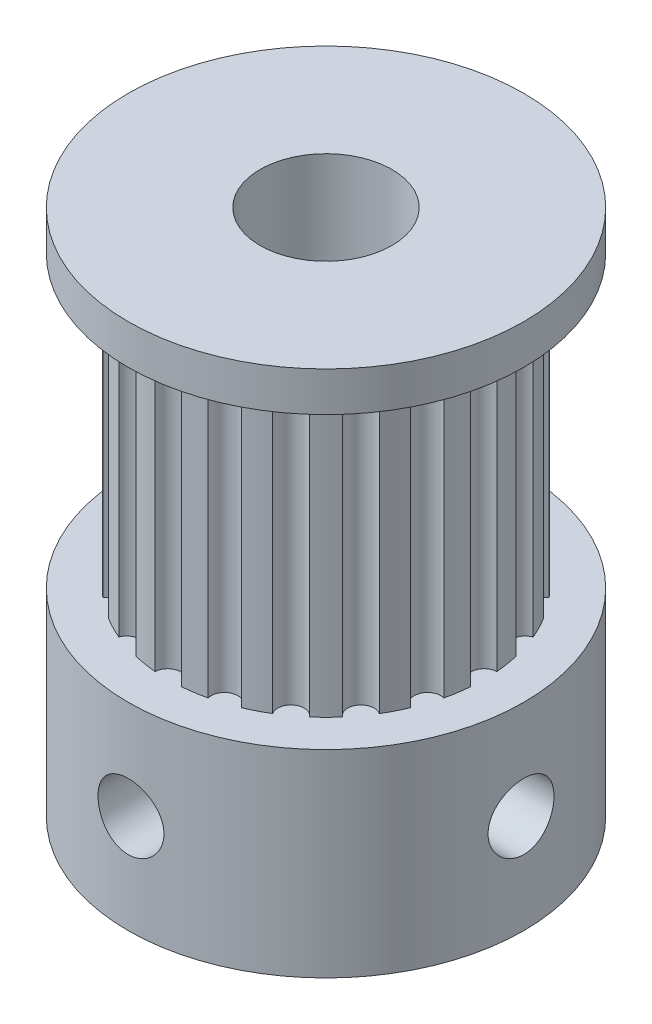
ISO-10303-21;
HEADER;
FILE_DESCRIPTION(('STEP AP214'),'2;1');
FILE_NAME('part.step','',(''),(''),'','','');
FILE_SCHEMA(('AUTOMOTIVE_DESIGN { 1 0 10303 214 1 1 1 1 }'));
ENDSEC;
DATA;
#1=APPLICATION_CONTEXT('core data for automotive mechanical design processes');
#2=APPLICATION_PROTOCOL_DEFINITION('international standard','automotive_design',2000,#1);
#3=PRODUCT_CONTEXT('',#1,'mechanical');
#4=PRODUCT('Part','Part','',(#3));
#5=PRODUCT_RELATED_PRODUCT_CATEGORY('part','',(#4));
#6=PRODUCT_DEFINITION_FORMATION('','',#4);
#7=PRODUCT_DEFINITION_CONTEXT('part definition',#1,'design');
#8=PRODUCT_DEFINITION('design','',#6,#7);
#9=PRODUCT_DEFINITION_SHAPE('','',#8);
#10=(LENGTH_UNIT() NAMED_UNIT(*) SI_UNIT(.MILLI.,.METRE.));
#11=(NAMED_UNIT(*) PLANE_ANGLE_UNIT() SI_UNIT($,.RADIAN.));
#12=(NAMED_UNIT(*) SI_UNIT($,.STERADIAN.) SOLID_ANGLE_UNIT());
#13=UNCERTAINTY_MEASURE_WITH_UNIT(LENGTH_MEASURE(1.E-05),#10,'distance_accuracy_value','');
#14=(GEOMETRIC_REPRESENTATION_CONTEXT(3) GLOBAL_UNCERTAINTY_ASSIGNED_CONTEXT((#13)) GLOBAL_UNIT_ASSIGNED_CONTEXT((#10,
#11,#12)) REPRESENTATION_CONTEXT('',''));
#15=CARTESIAN_POINT('',(0.,0.,0.));
#16=DIRECTION('',(0.,0.,1.));
#17=DIRECTION('',(1.,0.,0.));
#18=AXIS2_PLACEMENT_3D('',#15,#16,#17);
#19=CARTESIAN_POINT('',(0.,-10.,0.));
#20=DIRECTION('',(0.,-1.,0.));
#21=DIRECTION('',(1.,0.,0.));
#22=AXIS2_PLACEMENT_3D('',#19,#20,#21);
#23=CYLINDRICAL_SURFACE('',#22,6.);
#24=CARTESIAN_POINT('',(0.,-2.5,0.));
#25=DIRECTION('',(0.,-1.,0.));
#26=DIRECTION('',(1.,0.,0.));
#27=AXIS2_PLACEMENT_3D('',#24,#25,#26);
#28=CIRCLE('',#27,6.);
#29=CARTESIAN_POINT('',(3.91862319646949,-2.5,-4.54361004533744));
#30=VERTEX_POINT('',#29);
#31=CARTESIAN_POINT('',(4.54361004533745,-2.5,-3.91862319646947));
#32=VERTEX_POINT('',#31);
#33=EDGE_CURVE('E1252',#30,#32,#28,.T.);
#34=ORIENTED_EDGE('',*,*,#33,.F.);
#35=DIRECTION('',(0.,-1.,0.));
#36=VECTOR('',#35,1.);
#37=CARTESIAN_POINT('',(3.91862319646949,9.6827502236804,-4.54361004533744));
#38=LINE('',#37,#36);
#39=CARTESIAN_POINT('',(3.91862319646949,8.5,-4.54361004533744));
#40=VERTEX_POINT('',#39);
#41=EDGE_CURVE('E676',#40,#30,#38,.T.);
#42=ORIENTED_EDGE('',*,*,#41,.F.);
#43=CARTESIAN_POINT('',(0.,8.5,0.));
#44=DIRECTION('',(0.,-1.,0.));
#45=DIRECTION('',(1.,0.,0.));
#46=AXIS2_PLACEMENT_3D('',#43,#44,#45);
#47=CIRCLE('',#46,6.);
#48=CARTESIAN_POINT('',(4.54361004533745,8.5,-3.91862319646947));
#49=VERTEX_POINT('',#48);
#50=EDGE_CURVE('E508',#40,#49,#47,.T.);
#51=ORIENTED_EDGE('',*,*,#50,.T.);
#52=DIRECTION('',(0.,-1.,0.));
#53=VECTOR('',#52,1.);
#54=CARTESIAN_POINT('',(4.54361004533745,9.6827502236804,-3.91862319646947));
#55=LINE('',#54,#53);
#56=EDGE_CURVE('E668',#49,#32,#55,.T.);
#57=ORIENTED_EDGE('',*,*,#56,.T.);
#58=EDGE_LOOP('',(#34,#42,#51,#57));
#59=FACE_BOUND('',#58,.T.);
#60=ADVANCED_FACE('F38',(#59),#23,.T.);
#61=CARTESIAN_POINT('',(2.32277940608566,8.5,-5.53215110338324));
#62=VERTEX_POINT('',#61);
#63=CARTESIAN_POINT('',(3.11030877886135,8.5,-5.13088484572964));
#64=VERTEX_POINT('',#63);
#65=EDGE_CURVE('E333',#62,#64,#47,.T.);
#66=ORIENTED_EDGE('',*,*,#65,.T.);
#67=DIRECTION('',(0.,-1.,0.));
#68=VECTOR('',#67,1.);
#69=CARTESIAN_POINT('',(3.11030877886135,9.6827502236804,-5.13088484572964));
#70=LINE('',#69,#68);
#71=CARTESIAN_POINT('',(3.11030877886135,-2.5,-5.13088484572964));
#72=VERTEX_POINT('',#71);
#73=EDGE_CURVE('E519',#64,#72,#70,.T.);
#74=ORIENTED_EDGE('',*,*,#73,.T.);
#75=CARTESIAN_POINT('',(2.32277940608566,-2.5,-5.53215110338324));
#76=VERTEX_POINT('',#75);
#77=EDGE_CURVE('E326',#76,#72,#28,.T.);
#78=ORIENTED_EDGE('',*,*,#77,.F.);
#79=DIRECTION('',(0.,-1.,0.));
#80=VECTOR('',#79,1.);
#81=CARTESIAN_POINT('',(2.32277940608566,9.6580169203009,-5.53215110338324));
#82=LINE('',#81,#80);
#83=EDGE_CURVE('E401',#62,#76,#82,.T.);
#84=ORIENTED_EDGE('',*,*,#83,.F.);
#85=EDGE_LOOP('',(#66,#74,#78,#84));
#86=FACE_BOUND('',#85,.T.);
#87=ADVANCED_FACE('F359',(#86),#23,.T.);
#88=CARTESIAN_POINT('',(5.13088484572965,-2.5,-3.11030877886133));
#89=VERTEX_POINT('',#88);
#90=CARTESIAN_POINT('',(5.53215110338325,-2.5,-2.32277940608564));
#91=VERTEX_POINT('',#90);
#92=EDGE_CURVE('E1251',#89,#91,#28,.T.);
#93=ORIENTED_EDGE('',*,*,#92,.F.);
#94=DIRECTION('',(0.,-1.,0.));
#95=VECTOR('',#94,1.);
#96=CARTESIAN_POINT('',(5.13088484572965,9.6827502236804,-3.11030877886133));
#97=LINE('',#96,#95);
#98=CARTESIAN_POINT('',(5.13088484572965,8.5,-3.11030877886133));
#99=VERTEX_POINT('',#98);
#100=EDGE_CURVE('E670',#99,#89,#97,.T.);
#101=ORIENTED_EDGE('',*,*,#100,.F.);
#102=CARTESIAN_POINT('',(5.53215110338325,8.5,-2.32277940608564));
#103=VERTEX_POINT('',#102);
#104=EDGE_CURVE('E502',#99,#103,#47,.T.);
#105=ORIENTED_EDGE('',*,*,#104,.T.);
#106=DIRECTION('',(0.,-1.,0.));
#107=VECTOR('',#106,1.);
#108=CARTESIAN_POINT('',(5.53215110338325,9.6580169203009,-2.32277940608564));
#109=LINE('',#108,#107);
#110=EDGE_CURVE('E658',#103,#91,#109,.T.);
#111=ORIENTED_EDGE('',*,*,#110,.T.);
#112=EDGE_LOOP('',(#93,#101,#105,#111));
#113=FACE_BOUND('',#112,.T.);
#114=ADVANCED_FACE('F365',(#113),#23,.T.);
#115=CARTESIAN_POINT('',(5.84089973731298,-2.5,-1.37254881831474));
#116=VERTEX_POINT('',#115);
#117=CARTESIAN_POINT('',(5.97916666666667,-2.5,-0.499565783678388));
#118=VERTEX_POINT('',#117);
#119=EDGE_CURVE('E1253',#116,#118,#28,.T.);
#120=ORIENTED_EDGE('',*,*,#119,.F.);
#121=DIRECTION('',(0.,-1.,0.));
#122=VECTOR('',#121,1.);
#123=CARTESIAN_POINT('',(5.84089973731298,9.6580169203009,-1.37254881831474));
#124=LINE('',#123,#122);
#125=CARTESIAN_POINT('',(5.84089973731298,8.5,-1.37254881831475));
#126=VERTEX_POINT('',#125);
#127=EDGE_CURVE('E660',#126,#116,#124,.T.);
#128=ORIENTED_EDGE('',*,*,#127,.F.);
#129=CARTESIAN_POINT('',(5.97916666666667,8.5,-0.499565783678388));
#130=VERTEX_POINT('',#129);
#131=EDGE_CURVE('E496',#126,#130,#47,.T.);
#132=ORIENTED_EDGE('',*,*,#131,.T.);
#133=DIRECTION('',(0.,-1.,0.));
#134=VECTOR('',#133,1.);
#135=CARTESIAN_POINT('',(5.97916666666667,9.61725730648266,-0.499565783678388));
#136=LINE('',#135,#134);
#137=EDGE_CURVE('E648',#130,#118,#136,.T.);
#138=ORIENTED_EDGE('',*,*,#137,.T.);
#139=EDGE_LOOP('',(#120,#128,#132,#138));
#140=FACE_BOUND('',#139,.T.);
#141=ADVANCED_FACE('F1094',(#140),#23,.T.);
#142=CARTESIAN_POINT('',(5.97916666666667,-2.5,0.49956578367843));
#143=VERTEX_POINT('',#142);
#144=CARTESIAN_POINT('',(5.84089973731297,-2.5,1.37254881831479));
#145=VERTEX_POINT('',#144);
#146=EDGE_CURVE('E1256',#143,#145,#28,.T.);
#147=ORIENTED_EDGE('',*,*,#146,.F.);
#148=DIRECTION('',(0.,-1.,0.));
#149=VECTOR('',#148,1.);
#150=CARTESIAN_POINT('',(5.97916666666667,9.61725730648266,0.49956578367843));
#151=LINE('',#150,#149);
#152=CARTESIAN_POINT('',(5.97916666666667,8.5,0.49956578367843));
#153=VERTEX_POINT('',#152);
#154=EDGE_CURVE('E650',#153,#143,#151,.T.);
#155=ORIENTED_EDGE('',*,*,#154,.F.);
#156=CARTESIAN_POINT('',(5.84089973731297,8.5,1.37254881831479));
#157=VERTEX_POINT('',#156);
#158=EDGE_CURVE('E490',#153,#157,#47,.T.);
#159=ORIENTED_EDGE('',*,*,#158,.T.);
#160=DIRECTION('',(0.,-1.,0.));
#161=VECTOR('',#160,1.);
#162=CARTESIAN_POINT('',(5.84089973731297,9.6580169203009,1.37254881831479));
#163=LINE('',#162,#161);
#164=EDGE_CURVE('E638',#157,#145,#163,.T.);
#165=ORIENTED_EDGE('',*,*,#164,.T.);
#166=EDGE_LOOP('',(#147,#155,#159,#165));
#167=FACE_BOUND('',#166,.T.);
#168=ADVANCED_FACE('F1086',(#167),#23,.T.);
#169=CARTESIAN_POINT('',(5.53215110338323,-2.5,2.32277940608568));
#170=VERTEX_POINT('',#169);
#171=CARTESIAN_POINT('',(5.13088484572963,-2.5,3.11030877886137));
#172=VERTEX_POINT('',#171);
#173=EDGE_CURVE('E1259',#170,#172,#28,.T.);
#174=ORIENTED_EDGE('',*,*,#173,.F.);
#175=DIRECTION('',(0.,-1.,0.));
#176=VECTOR('',#175,1.);
#177=CARTESIAN_POINT('',(5.53215110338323,9.6580169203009,2.32277940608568));
#178=LINE('',#177,#176);
#179=CARTESIAN_POINT('',(5.53215110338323,8.5,2.32277940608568));
#180=VERTEX_POINT('',#179);
#181=EDGE_CURVE('E640',#180,#170,#178,.T.);
#182=ORIENTED_EDGE('',*,*,#181,.F.);
#183=CARTESIAN_POINT('',(5.13088484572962,8.5,3.11030877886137));
#184=VERTEX_POINT('',#183);
#185=EDGE_CURVE('E484',#180,#184,#47,.T.);
#186=ORIENTED_EDGE('',*,*,#185,.T.);
#187=DIRECTION('',(0.,-1.,0.));
#188=VECTOR('',#187,1.);
#189=CARTESIAN_POINT('',(5.13088484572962,9.6827502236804,3.11030877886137));
#190=LINE('',#189,#188);
#191=EDGE_CURVE('E628',#184,#172,#190,.T.);
#192=ORIENTED_EDGE('',*,*,#191,.T.);
#193=EDGE_LOOP('',(#174,#182,#186,#192));
#194=FACE_BOUND('',#193,.T.);
#195=ADVANCED_FACE('F1078',(#194),#23,.T.);
#196=CARTESIAN_POINT('',(4.54361004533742,-2.5,3.91862319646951));
#197=VERTEX_POINT('',#196);
#198=CARTESIAN_POINT('',(3.91862319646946,-2.5,4.54361004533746));
#199=VERTEX_POINT('',#198);
#200=EDGE_CURVE('E1262',#197,#199,#28,.T.);
#201=ORIENTED_EDGE('',*,*,#200,.F.);
#202=DIRECTION('',(0.,-1.,0.));
#203=VECTOR('',#202,1.);
#204=CARTESIAN_POINT('',(4.54361004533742,9.6827502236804,3.91862319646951));
#205=LINE('',#204,#203);
#206=CARTESIAN_POINT('',(4.54361004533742,8.5,3.91862319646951));
#207=VERTEX_POINT('',#206);
#208=EDGE_CURVE('E630',#207,#197,#205,.T.);
#209=ORIENTED_EDGE('',*,*,#208,.F.);
#210=CARTESIAN_POINT('',(3.91862319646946,8.5,4.54361004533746));
#211=VERTEX_POINT('',#210);
#212=EDGE_CURVE('E478',#207,#211,#47,.T.);
#213=ORIENTED_EDGE('',*,*,#212,.T.);
#214=DIRECTION('',(0.,-1.,0.));
#215=VECTOR('',#214,1.);
#216=CARTESIAN_POINT('',(3.91862319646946,9.6827502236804,4.54361004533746));
#217=LINE('',#216,#215);
#218=EDGE_CURVE('E618',#211,#199,#217,.T.);
#219=ORIENTED_EDGE('',*,*,#218,.T.);
#220=EDGE_LOOP('',(#201,#209,#213,#219));
#221=FACE_BOUND('',#220,.T.);
#222=ADVANCED_FACE('F1070',(#221),#23,.T.);
#223=CARTESIAN_POINT('',(3.11030877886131,-2.5,5.13088484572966));
#224=VERTEX_POINT('',#223);
#225=CARTESIAN_POINT('',(2.32277940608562,-2.5,5.53215110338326));
#226=VERTEX_POINT('',#225);
#227=EDGE_CURVE('E1265',#224,#226,#28,.T.);
#228=ORIENTED_EDGE('',*,*,#227,.F.);
#229=DIRECTION('',(0.,-1.,0.));
#230=VECTOR('',#229,1.);
#231=CARTESIAN_POINT('',(3.11030877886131,9.6827502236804,5.13088484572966));
#232=LINE('',#231,#230);
#233=CARTESIAN_POINT('',(3.11030877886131,8.5,5.13088484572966));
#234=VERTEX_POINT('',#233);
#235=EDGE_CURVE('E620',#234,#224,#232,.T.);
#236=ORIENTED_EDGE('',*,*,#235,.F.);
#237=CARTESIAN_POINT('',(2.32277940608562,8.5,5.53215110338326));
#238=VERTEX_POINT('',#237);
#239=EDGE_CURVE('E472',#234,#238,#47,.T.);
#240=ORIENTED_EDGE('',*,*,#239,.T.);
#241=DIRECTION('',(0.,-1.,0.));
#242=VECTOR('',#241,1.);
#243=CARTESIAN_POINT('',(2.32277940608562,9.6580169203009,5.53215110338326));
#244=LINE('',#243,#242);
#245=EDGE_CURVE('E608',#238,#226,#244,.T.);
#246=ORIENTED_EDGE('',*,*,#245,.T.);
#247=EDGE_LOOP('',(#228,#236,#240,#246));
#248=FACE_BOUND('',#247,.T.);
#249=ADVANCED_FACE('F1062',(#248),#23,.T.);
#250=CARTESIAN_POINT('',(1.37254881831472,-2.5,5.84089973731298));
#251=VERTEX_POINT('',#250);
#252=CARTESIAN_POINT('',(0.499565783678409,-2.5,5.97916666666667));
#253=VERTEX_POINT('',#252);
#254=EDGE_CURVE('E1268',#251,#253,#28,.T.);
#255=ORIENTED_EDGE('',*,*,#254,.F.);
#256=DIRECTION('',(0.,-1.,0.));
#257=VECTOR('',#256,1.);
#258=CARTESIAN_POINT('',(1.37254881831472,9.6580169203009,5.84089973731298));
#259=LINE('',#258,#257);
#260=CARTESIAN_POINT('',(1.37254881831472,8.5,5.84089973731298));
#261=VERTEX_POINT('',#260);
#262=EDGE_CURVE('E610',#261,#251,#259,.T.);
#263=ORIENTED_EDGE('',*,*,#262,.F.);
#264=CARTESIAN_POINT('',(0.499565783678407,8.5,5.97916666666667));
#265=VERTEX_POINT('',#264);
#266=EDGE_CURVE('E466',#261,#265,#47,.T.);
#267=ORIENTED_EDGE('',*,*,#266,.T.);
#268=DIRECTION('',(0.,-1.,0.));
#269=VECTOR('',#268,1.);
#270=CARTESIAN_POINT('',(0.499565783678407,9.61725730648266,5.97916666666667));
#271=LINE('',#270,#269);
#272=EDGE_CURVE('E598',#265,#253,#271,.T.);
#273=ORIENTED_EDGE('',*,*,#272,.T.);
#274=EDGE_LOOP('',(#255,#263,#267,#273));
#275=FACE_BOUND('',#274,.T.);
#276=ADVANCED_FACE('F1054',(#275),#23,.T.);
#277=CARTESIAN_POINT('',(-0.499565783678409,-2.5,5.97916666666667));
#278=VERTEX_POINT('',#277);
#279=CARTESIAN_POINT('',(-1.37254881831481,-2.5,5.84089973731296));
#280=VERTEX_POINT('',#279);
#281=EDGE_CURVE('E1271',#278,#280,#28,.T.);
#282=ORIENTED_EDGE('',*,*,#281,.F.);
#283=DIRECTION('',(0.,-1.,0.));
#284=VECTOR('',#283,1.);
#285=CARTESIAN_POINT('',(-0.499565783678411,9.61725730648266,5.97916666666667));
#286=LINE('',#285,#284);
#287=CARTESIAN_POINT('',(-0.49956578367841,8.5,5.97916666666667));
#288=VERTEX_POINT('',#287);
#289=EDGE_CURVE('E600',#288,#278,#286,.T.);
#290=ORIENTED_EDGE('',*,*,#289,.F.);
#291=CARTESIAN_POINT('',(-1.37254881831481,8.5,5.84089973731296));
#292=VERTEX_POINT('',#291);
#293=EDGE_CURVE('E460',#288,#292,#47,.T.);
#294=ORIENTED_EDGE('',*,*,#293,.T.);
#295=DIRECTION('',(0.,-1.,0.));
#296=VECTOR('',#295,1.);
#297=CARTESIAN_POINT('',(-1.37254881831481,9.6580169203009,5.84089973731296));
#298=LINE('',#297,#296);
#299=EDGE_CURVE('E588',#292,#280,#298,.T.);
#300=ORIENTED_EDGE('',*,*,#299,.T.);
#301=EDGE_LOOP('',(#282,#290,#294,#300));
#302=FACE_BOUND('',#301,.T.);
#303=ADVANCED_FACE('F1046',(#302),#23,.T.);
#304=CARTESIAN_POINT('',(-2.3227794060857,-2.5,5.53215110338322));
#305=VERTEX_POINT('',#304);
#306=CARTESIAN_POINT('',(-3.11030877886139,-2.5,5.13088484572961));
#307=VERTEX_POINT('',#306);
#308=EDGE_CURVE('E1274',#305,#307,#28,.T.);
#309=ORIENTED_EDGE('',*,*,#308,.F.);
#310=DIRECTION('',(0.,-1.,0.));
#311=VECTOR('',#310,1.);
#312=CARTESIAN_POINT('',(-2.3227794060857,9.6580169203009,5.53215110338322));
#313=LINE('',#312,#311);
#314=CARTESIAN_POINT('',(-2.3227794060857,8.5,5.53215110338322));
#315=VERTEX_POINT('',#314);
#316=EDGE_CURVE('E590',#315,#305,#313,.T.);
#317=ORIENTED_EDGE('',*,*,#316,.F.);
#318=CARTESIAN_POINT('',(-3.11030877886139,8.5,5.13088484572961));
#319=VERTEX_POINT('',#318);
#320=EDGE_CURVE('E454',#315,#319,#47,.T.);
#321=ORIENTED_EDGE('',*,*,#320,.T.);
#322=DIRECTION('',(0.,-1.,0.));
#323=VECTOR('',#322,1.);
#324=CARTESIAN_POINT('',(-3.11030877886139,9.6827502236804,5.13088484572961));
#325=LINE('',#324,#323);
#326=EDGE_CURVE('E578',#319,#307,#325,.T.);
#327=ORIENTED_EDGE('',*,*,#326,.T.);
#328=EDGE_LOOP('',(#309,#317,#321,#327));
#329=FACE_BOUND('',#328,.T.);
#330=ADVANCED_FACE('F1038',(#329),#23,.T.);
#331=CARTESIAN_POINT('',(-3.91862319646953,-2.5,4.54361004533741));
#332=VERTEX_POINT('',#331);
#333=CARTESIAN_POINT('',(-4.54361004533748,-2.5,3.91862319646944));
#334=VERTEX_POINT('',#333);
#335=EDGE_CURVE('E1277',#332,#334,#28,.T.);
#336=ORIENTED_EDGE('',*,*,#335,.F.);
#337=DIRECTION('',(0.,-1.,0.));
#338=VECTOR('',#337,1.);
#339=CARTESIAN_POINT('',(-3.91862319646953,9.6827502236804,4.54361004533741));
#340=LINE('',#339,#338);
#341=CARTESIAN_POINT('',(-3.91862319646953,8.5,4.54361004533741));
#342=VERTEX_POINT('',#341);
#343=EDGE_CURVE('E580',#342,#332,#340,.T.);
#344=ORIENTED_EDGE('',*,*,#343,.F.);
#345=CARTESIAN_POINT('',(-4.54361004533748,8.5,3.91862319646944));
#346=VERTEX_POINT('',#345);
#347=EDGE_CURVE('E448',#342,#346,#47,.T.);
#348=ORIENTED_EDGE('',*,*,#347,.T.);
#349=DIRECTION('',(0.,-1.,0.));
#350=VECTOR('',#349,1.);
#351=CARTESIAN_POINT('',(-4.54361004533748,9.6827502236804,3.91862319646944));
#352=LINE('',#351,#350);
#353=EDGE_CURVE('E568',#346,#334,#352,.T.);
#354=ORIENTED_EDGE('',*,*,#353,.T.);
#355=EDGE_LOOP('',(#336,#344,#348,#354));
#356=FACE_BOUND('',#355,.T.);
#357=ADVANCED_FACE('F1030',(#356),#23,.T.);
#358=CARTESIAN_POINT('',(-5.13088484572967,-2.5,3.11030877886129));
#359=VERTEX_POINT('',#358);
#360=CARTESIAN_POINT('',(-5.53215110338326,-2.5,2.3227794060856));
#361=VERTEX_POINT('',#360);
#362=EDGE_CURVE('E1280',#359,#361,#28,.T.);
#363=ORIENTED_EDGE('',*,*,#362,.F.);
#364=DIRECTION('',(0.,-1.,0.));
#365=VECTOR('',#364,1.);
#366=CARTESIAN_POINT('',(-5.13088484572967,9.6827502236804,3.11030877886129));
#367=LINE('',#366,#365);
#368=CARTESIAN_POINT('',(-5.13088484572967,8.5,3.11030877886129));
#369=VERTEX_POINT('',#368);
#370=EDGE_CURVE('E570',#369,#359,#367,.T.);
#371=ORIENTED_EDGE('',*,*,#370,.F.);
#372=CARTESIAN_POINT('',(-5.53215110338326,8.5,2.3227794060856));
#373=VERTEX_POINT('',#372);
#374=EDGE_CURVE('E442',#369,#373,#47,.T.);
#375=ORIENTED_EDGE('',*,*,#374,.T.);
#376=DIRECTION('',(0.,-1.,0.));
#377=VECTOR('',#376,1.);
#378=CARTESIAN_POINT('',(-5.53215110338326,9.6580169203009,2.3227794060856));
#379=LINE('',#378,#377);
#380=EDGE_CURVE('E558',#373,#361,#379,.T.);
#381=ORIENTED_EDGE('',*,*,#380,.T.);
#382=EDGE_LOOP('',(#363,#371,#375,#381));
#383=FACE_BOUND('',#382,.T.);
#384=ADVANCED_FACE('F1022',(#383),#23,.T.);
#385=CARTESIAN_POINT('',(-5.84089973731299,-2.5,1.37254881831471));
#386=VERTEX_POINT('',#385);
#387=CARTESIAN_POINT('',(-5.97916666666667,-2.5,0.499565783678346));
#388=VERTEX_POINT('',#387);
#389=EDGE_CURVE('E1283',#386,#388,#28,.T.);
#390=ORIENTED_EDGE('',*,*,#389,.F.);
#391=DIRECTION('',(0.,-1.,0.));
#392=VECTOR('',#391,1.);
#393=CARTESIAN_POINT('',(-5.84089973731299,9.6580169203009,1.3725488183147));
#394=LINE('',#393,#392);
#395=CARTESIAN_POINT('',(-5.84089973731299,8.5,1.3725488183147));
#396=VERTEX_POINT('',#395);
#397=EDGE_CURVE('E560',#396,#386,#394,.T.);
#398=ORIENTED_EDGE('',*,*,#397,.F.);
#399=CARTESIAN_POINT('',(-5.97916666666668,8.5,0.499565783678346));
#400=VERTEX_POINT('',#399);
#401=EDGE_CURVE('E436',#396,#400,#47,.T.);
#402=ORIENTED_EDGE('',*,*,#401,.T.);
#403=DIRECTION('',(0.,-1.,0.));
#404=VECTOR('',#403,1.);
#405=CARTESIAN_POINT('',(-5.97916666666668,9.61725730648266,0.499565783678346));
#406=LINE('',#405,#404);
#407=EDGE_CURVE('E548',#400,#388,#406,.T.);
#408=ORIENTED_EDGE('',*,*,#407,.T.);
#409=EDGE_LOOP('',(#390,#398,#402,#408));
#410=FACE_BOUND('',#409,.T.);
#411=ADVANCED_FACE('F1014',(#410),#23,.T.);
#412=CARTESIAN_POINT('',(-5.97916666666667,-2.5,-0.499565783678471));
#413=VERTEX_POINT('',#412);
#414=CARTESIAN_POINT('',(-5.84089973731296,-2.5,-1.37254881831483));
#415=VERTEX_POINT('',#414);
#416=EDGE_CURVE('E320',#413,#415,#28,.T.);
#417=ORIENTED_EDGE('',*,*,#416,.F.);
#418=DIRECTION('',(0.,-1.,0.));
#419=VECTOR('',#418,1.);
#420=CARTESIAN_POINT('',(-5.97916666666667,9.61725730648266,-0.499565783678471));
#421=LINE('',#420,#419);
#422=CARTESIAN_POINT('',(-5.97916666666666,8.5,-0.499565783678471));
#423=VERTEX_POINT('',#422);
#424=EDGE_CURVE('E550',#423,#413,#421,.T.);
#425=ORIENTED_EDGE('',*,*,#424,.F.);
#426=CARTESIAN_POINT('',(-5.84089973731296,8.5,-1.37254881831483));
#427=VERTEX_POINT('',#426);
#428=EDGE_CURVE('E430',#423,#427,#47,.T.);
#429=ORIENTED_EDGE('',*,*,#428,.T.);
#430=DIRECTION('',(0.,-1.,0.));
#431=VECTOR('',#430,1.);
#432=CARTESIAN_POINT('',(-5.84089973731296,9.6580169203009,-1.37254881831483));
#433=LINE('',#432,#431);
#434=EDGE_CURVE('E538',#427,#415,#433,.T.);
#435=ORIENTED_EDGE('',*,*,#434,.T.);
#436=EDGE_LOOP('',(#417,#425,#429,#435));
#437=FACE_BOUND('',#436,.T.);
#438=ADVANCED_FACE('F1006',(#437),#23,.T.);
#439=CARTESIAN_POINT('',(-5.53215110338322,-2.5,-2.32277940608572));
#440=VERTEX_POINT('',#439);
#441=CARTESIAN_POINT('',(-5.1308848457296,-2.5,-3.1103087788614));
#442=VERTEX_POINT('',#441);
#443=EDGE_CURVE('E317',#440,#442,#28,.T.);
#444=ORIENTED_EDGE('',*,*,#443,.F.);
#445=DIRECTION('',(0.,-1.,0.));
#446=VECTOR('',#445,1.);
#447=CARTESIAN_POINT('',(-5.53215110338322,9.6580169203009,-2.32277940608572));
#448=LINE('',#447,#446);
#449=CARTESIAN_POINT('',(-5.53215110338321,8.5,-2.32277940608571));
#450=VERTEX_POINT('',#449);
#451=EDGE_CURVE('E540',#450,#440,#448,.T.);
#452=ORIENTED_EDGE('',*,*,#451,.F.);
#453=CARTESIAN_POINT('',(-5.13088484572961,8.5,-3.1103087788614));
#454=VERTEX_POINT('',#453);
#455=EDGE_CURVE('E428',#450,#454,#47,.T.);
#456=ORIENTED_EDGE('',*,*,#455,.T.);
#457=DIRECTION('',(0.,-1.,0.));
#458=VECTOR('',#457,1.);
#459=CARTESIAN_POINT('',(-5.13088484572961,9.6827502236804,-3.1103087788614));
#460=LINE('',#459,#458);
#461=EDGE_CURVE('E529',#454,#442,#460,.T.);
#462=ORIENTED_EDGE('',*,*,#461,.T.);
#463=EDGE_LOOP('',(#444,#452,#456,#462));
#464=FACE_BOUND('',#463,.T.);
#465=ADVANCED_FACE('F998',(#464),#23,.T.);
#466=CARTESIAN_POINT('',(-4.5436100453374,-2.5,-3.91862319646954));
#467=VERTEX_POINT('',#466);
#468=CARTESIAN_POINT('',(-3.91862319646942,-2.5,-4.54361004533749));
#469=VERTEX_POINT('',#468);
#470=EDGE_CURVE('E306',#467,#469,#28,.T.);
#471=ORIENTED_EDGE('',*,*,#470,.F.);
#472=DIRECTION('',(0.,-1.,0.));
#473=VECTOR('',#472,1.);
#474=CARTESIAN_POINT('',(-4.5436100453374,9.6827502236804,-3.91862319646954));
#475=LINE('',#474,#473);
#476=CARTESIAN_POINT('',(-4.54361004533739,8.5,-3.91862319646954));
#477=VERTEX_POINT('',#476);
#478=EDGE_CURVE('E531',#477,#467,#475,.T.);
#479=ORIENTED_EDGE('',*,*,#478,.F.);
#480=CARTESIAN_POINT('',(-3.91862319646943,8.5,-4.54361004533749));
#481=VERTEX_POINT('',#480);
#482=EDGE_CURVE('E308',#477,#481,#47,.T.);
#483=ORIENTED_EDGE('',*,*,#482,.T.);
#484=DIRECTION('',(0.,-1.,0.));
#485=VECTOR('',#484,1.);
#486=CARTESIAN_POINT('',(-3.91862319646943,9.6827502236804,-4.54361004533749));
#487=LINE('',#486,#485);
#488=EDGE_CURVE('E294',#481,#469,#487,.T.);
#489=ORIENTED_EDGE('',*,*,#488,.T.);
#490=EDGE_LOOP('',(#471,#479,#483,#489));
#491=FACE_BOUND('',#490,.T.);
#492=ADVANCED_FACE('F304',(#491),#23,.T.);
#493=CARTESIAN_POINT('',(-3.11030877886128,-2.5,-5.13088484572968));
#494=VERTEX_POINT('',#493);
#495=CARTESIAN_POINT('',(-2.32277940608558,-2.5,-5.53215110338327));
#496=VERTEX_POINT('',#495);
#497=EDGE_CURVE('E318',#494,#496,#28,.T.);
#498=ORIENTED_EDGE('',*,*,#497,.F.);
#499=DIRECTION('',(0.,-1.,0.));
#500=VECTOR('',#499,1.);
#501=CARTESIAN_POINT('',(-3.11030877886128,9.6827502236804,-5.13088484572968));
#502=LINE('',#501,#500);
#503=CARTESIAN_POINT('',(-3.11030877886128,8.5,-5.13088484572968));
#504=VERTEX_POINT('',#503);
#505=EDGE_CURVE('E297',#504,#494,#502,.T.);
#506=ORIENTED_EDGE('',*,*,#505,.F.);
#507=CARTESIAN_POINT('',(-2.32277940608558,8.5,-5.53215110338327));
#508=VERTEX_POINT('',#507);
#509=EDGE_CURVE('E423',#504,#508,#47,.T.);
#510=ORIENTED_EDGE('',*,*,#509,.T.);
#511=DIRECTION('',(0.,-1.,0.));
#512=VECTOR('',#511,1.);
#513=CARTESIAN_POINT('',(-2.32277940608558,9.6580169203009,-5.53215110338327));
#514=LINE('',#513,#512);
#515=EDGE_CURVE('E681',#508,#496,#514,.T.);
#516=ORIENTED_EDGE('',*,*,#515,.T.);
#517=EDGE_LOOP('',(#498,#506,#510,#516));
#518=FACE_BOUND('',#517,.T.);
#519=ADVANCED_FACE('F376',(#518),#23,.T.);
#520=CARTESIAN_POINT('',(-1.37254881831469,-2.5,-5.84089973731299));
#521=VERTEX_POINT('',#520);
#522=CARTESIAN_POINT('',(-0.499565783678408,-2.5,-5.97916666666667));
#523=VERTEX_POINT('',#522);
#524=EDGE_CURVE('E321',#521,#523,#28,.T.);
#525=ORIENTED_EDGE('',*,*,#524,.F.);
#526=DIRECTION('',(0.,-1.,0.));
#527=VECTOR('',#526,1.);
#528=CARTESIAN_POINT('',(-1.37254881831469,9.6580169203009,-5.84089973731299));
#529=LINE('',#528,#527);
#530=CARTESIAN_POINT('',(-1.37254881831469,8.5,-5.84089973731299));
#531=VERTEX_POINT('',#530);
#532=EDGE_CURVE('E421',#531,#521,#529,.T.);
#533=ORIENTED_EDGE('',*,*,#532,.F.);
#534=CARTESIAN_POINT('',(-0.49956578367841,8.5,-5.97916666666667));
#535=VERTEX_POINT('',#534);
#536=EDGE_CURVE('E325',#531,#535,#47,.T.);
#537=ORIENTED_EDGE('',*,*,#536,.T.);
#538=DIRECTION('',(0.,-1.,0.));
#539=VECTOR('',#538,1.);
#540=CARTESIAN_POINT('',(-0.499565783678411,9.61725730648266,-5.97916666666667));
#541=LINE('',#540,#539);
#542=EDGE_CURVE('E406',#535,#523,#541,.T.);
#543=ORIENTED_EDGE('',*,*,#542,.T.);
#544=EDGE_LOOP('',(#525,#533,#537,#543));
#545=FACE_BOUND('',#544,.T.);
#546=ADVANCED_FACE('F371',(#545),#23,.T.);
#547=CARTESIAN_POINT('',(0.499565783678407,8.5,-5.97916666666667));
#548=VERTEX_POINT('',#547);
#549=CARTESIAN_POINT('',(1.37254881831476,8.5,-5.84089973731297));
#550=VERTEX_POINT('',#549);
#551=EDGE_CURVE('E329',#548,#550,#47,.T.);
#552=ORIENTED_EDGE('',*,*,#551,.T.);
#553=DIRECTION('',(0.,-1.,0.));
#554=VECTOR('',#553,1.);
#555=CARTESIAN_POINT('',(1.37254881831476,9.6580169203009,-5.84089973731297));
#556=LINE('',#555,#554);
#557=CARTESIAN_POINT('',(1.37254881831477,-2.5,-5.84089973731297));
#558=VERTEX_POINT('',#557);
#559=EDGE_CURVE('E382',#550,#558,#556,.T.);
#560=ORIENTED_EDGE('',*,*,#559,.T.);
#561=CARTESIAN_POINT('',(0.499565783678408,-2.5,-5.97916666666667));
#562=VERTEX_POINT('',#561);
#563=EDGE_CURVE('E322',#562,#558,#28,.T.);
#564=ORIENTED_EDGE('',*,*,#563,.F.);
#565=DIRECTION('',(0.,-1.,0.));
#566=VECTOR('',#565,1.);
#567=CARTESIAN_POINT('',(0.499565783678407,9.61725730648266,-5.97916666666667));
#568=LINE('',#567,#566);
#569=EDGE_CURVE('E384',#548,#562,#568,.T.);
#570=ORIENTED_EDGE('',*,*,#569,.F.);
#571=EDGE_LOOP('',(#552,#560,#564,#570));
#572=FACE_BOUND('',#571,.T.);
#573=ADVANCED_FACE('F353',(#572),#23,.T.);
#574=CARTESIAN_POINT('',(7.5,-10.,0.));
#575=DIRECTION('',(0.,-1.,0.));
#576=DIRECTION('',(1.,0.,0.));
#577=AXIS2_PLACEMENT_3D('',#574,#575,#576);
#578=PLANE('',#577);
#579=CARTESIAN_POINT('',(0.,-10.,0.));
#580=DIRECTION('',(0.,-1.,0.));
#581=DIRECTION('',(1.,0.,0.));
#582=AXIS2_PLACEMENT_3D('',#579,#580,#581);
#583=CIRCLE('',#582,7.5);
#584=CARTESIAN_POINT('',(7.5,-10.,0.));
#585=VERTEX_POINT('',#584);
#586=EDGE_CURVE('E409',#585,#585,#583,.T.);
#587=ORIENTED_EDGE('',*,*,#586,.T.);
#588=EDGE_LOOP('',(#587));
#589=FACE_BOUND('',#588,.T.);
#590=CARTESIAN_POINT('',(0.,-10.,0.));
#591=DIRECTION('',(0.,-1.,0.));
#592=DIRECTION('',(1.,0.,0.));
#593=AXIS2_PLACEMENT_3D('',#590,#591,#592);
#594=CIRCLE('',#593,2.5);
#595=CARTESIAN_POINT('',(2.5,-10.,0.));
#596=VERTEX_POINT('',#595);
#597=EDGE_CURVE('E11',#596,#596,#594,.T.);
#598=ORIENTED_EDGE('',*,*,#597,.F.);
#599=EDGE_LOOP('',(#598));
#600=FACE_BOUND('',#599,.T.);
#601=ADVANCED_FACE('F40',(#589,#600),#578,.T.);
#602=CARTESIAN_POINT('',(0.,-10.,0.));
#603=DIRECTION('',(0.,-1.,0.));
#604=DIRECTION('',(1.,0.,0.));
#605=AXIS2_PLACEMENT_3D('',#602,#603,#604);
#606=CYLINDRICAL_SURFACE('',#605,2.5);
#607=CARTESIAN_POINT('',(2.5,-5.00000000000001,0.));
#608=CARTESIAN_POINT('',(2.49999641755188,-5.00000412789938,-0.0657149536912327));
#609=CARTESIAN_POINT('',(2.49738113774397,-5.0052125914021,-0.13150824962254));
#610=CARTESIAN_POINT('',(2.48717695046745,-5.02581610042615,-0.26115029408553));
#611=CARTESIAN_POINT('',(2.47957859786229,-5.04123049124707,-0.324995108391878));
#612=CARTESIAN_POINT('',(2.46020349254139,-5.081492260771,-0.448666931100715));
#613=CARTESIAN_POINT('',(2.448442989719,-5.10630298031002,-0.508508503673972));
#614=CARTESIAN_POINT('',(2.42182220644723,-5.16446327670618,-0.623090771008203));
#615=CARTESIAN_POINT('',(2.40696217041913,-5.19781218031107,-0.677831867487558));
#616=CARTESIAN_POINT('',(2.37445322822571,-5.27439656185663,-0.784384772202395));
#617=CARTESIAN_POINT('',(2.3566899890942,-5.31810809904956,-0.835819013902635));
#618=CARTESIAN_POINT('',(2.32074962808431,-5.4131518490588,-0.930974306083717));
#619=CARTESIAN_POINT('',(2.30257220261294,-5.46448981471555,-0.974689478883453));
#620=CARTESIAN_POINT('',(2.26623688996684,-5.57810418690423,-1.05656500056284));
#621=CARTESIAN_POINT('',(2.24818983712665,-5.6409201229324,-1.09403166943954));
#622=CARTESIAN_POINT('',(2.21607473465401,-5.77295916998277,-1.15771028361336));
#623=CARTESIAN_POINT('',(2.20200384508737,-5.84217766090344,-1.18393026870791));
#624=CARTESIAN_POINT('',(2.18072333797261,-5.9808313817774,-1.22266555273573));
#625=CARTESIAN_POINT('',(2.17315339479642,-6.05000556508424,-1.23590732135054));
#626=CARTESIAN_POINT('',(2.1647736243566,-6.18997354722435,-1.25053374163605));
#627=CARTESIAN_POINT('',(2.1639571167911,-6.26076567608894,-1.25193011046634));
#628=CARTESIAN_POINT('',(2.16888662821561,-6.39285753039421,-1.24335910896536));
#629=CARTESIAN_POINT('',(2.17385954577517,-6.45428003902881,-1.23473069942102));
#630=CARTESIAN_POINT('',(2.18845285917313,-6.5746523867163,-1.20867481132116));
#631=CARTESIAN_POINT('',(2.19807473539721,-6.63360143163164,-1.19124452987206));
#632=CARTESIAN_POINT('',(2.22109345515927,-6.74903641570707,-1.1477622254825));
#633=CARTESIAN_POINT('',(2.23457300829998,-6.80543299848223,-1.12151883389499));
#634=CARTESIAN_POINT('',(2.26379255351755,-6.91329286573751,-1.061302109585));
#635=CARTESIAN_POINT('',(2.27953355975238,-6.96475391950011,-1.02732530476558));
#636=CARTESIAN_POINT('',(2.31391447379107,-7.06815156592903,-0.94758256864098));
#637=CARTESIAN_POINT('',(2.33266887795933,-7.11932109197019,-0.900868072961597));
#638=CARTESIAN_POINT('',(2.36934529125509,-7.21341927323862,-0.799444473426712));
#639=CARTESIAN_POINT('',(2.38726689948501,-7.25634399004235,-0.744731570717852));
#640=CARTESIAN_POINT('',(2.42127484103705,-7.33460707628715,-0.625645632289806));
#641=CARTESIAN_POINT('',(2.43723730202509,-7.36950059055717,-0.560941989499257));
#642=CARTESIAN_POINT('',(2.46447351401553,-7.42762128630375,-0.425582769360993));
#643=CARTESIAN_POINT('',(2.47575098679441,-7.45085773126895,-0.354931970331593));
#644=CARTESIAN_POINT('',(2.49155417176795,-7.48309425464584,-0.215958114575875));
#645=CARTESIAN_POINT('',(2.4965617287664,-7.49311404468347,-0.147926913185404));
#646=CARTESIAN_POINT('',(2.50091266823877,-7.5018309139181,-0.0109744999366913));
#647=CARTESIAN_POINT('',(2.5002587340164,-7.50053335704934,0.057946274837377));
#648=CARTESIAN_POINT('',(2.49363990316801,-7.48724163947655,0.189041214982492));
#649=CARTESIAN_POINT('',(2.48809057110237,-7.47608433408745,0.251324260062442));
#650=CARTESIAN_POINT('',(2.47277714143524,-7.44470241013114,0.373008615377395));
#651=CARTESIAN_POINT('',(2.46301257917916,-7.42447679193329,0.432409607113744));
#652=CARTESIAN_POINT('',(2.43980314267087,-7.37500191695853,0.548610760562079));
#653=CARTESIAN_POINT('',(2.42626102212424,-7.34551118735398,0.605287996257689));
#654=CARTESIAN_POINT('',(2.39679967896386,-7.27861558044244,0.713076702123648));
#655=CARTESIAN_POINT('',(2.38087944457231,-7.2412073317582,0.764185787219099));
#656=CARTESIAN_POINT('',(2.34635276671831,-7.1552994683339,0.864709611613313));
#657=CARTESIAN_POINT('',(2.32763606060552,-7.10607141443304,0.913465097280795));
#658=CARTESIAN_POINT('',(2.29077989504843,-7.00009356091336,1.00232040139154));
#659=CARTESIAN_POINT('',(2.27264084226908,-6.94333860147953,1.04241423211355));
#660=CARTESIAN_POINT('',(2.23813990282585,-6.8204454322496,1.11463489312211));
#661=CARTESIAN_POINT('',(2.2219066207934,-6.75398591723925,1.14628186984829));
#662=CARTESIAN_POINT('',(2.19467590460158,-6.61561241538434,1.19760353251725));
#663=CARTESIAN_POINT('',(2.18367172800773,-6.54370559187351,1.21729364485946));
#664=CARTESIAN_POINT('',(2.16951876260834,-6.40386222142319,1.24232710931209));
#665=CARTESIAN_POINT('',(2.16571729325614,-6.3362071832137,1.24886624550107));
#666=CARTESIAN_POINT('',(2.16456693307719,-6.20069116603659,1.25086144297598));
#667=CARTESIAN_POINT('',(2.16721524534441,-6.13283028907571,1.24632230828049));
#668=CARTESIAN_POINT('',(2.17797327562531,-6.00564562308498,1.22740765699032));
#669=CARTESIAN_POINT('',(2.18553868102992,-5.9461244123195,1.21401039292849));
#670=CARTESIAN_POINT('',(2.20463770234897,-5.83023985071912,1.1789691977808));
#671=CARTESIAN_POINT('',(2.21617259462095,-5.77387752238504,1.15732261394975));
#672=CARTESIAN_POINT('',(2.2428566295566,-5.66171893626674,1.10476968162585));
#673=CARTESIAN_POINT('',(2.25819652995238,-5.60621512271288,1.07333892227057));
#674=CARTESIAN_POINT('',(2.29044164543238,-5.50090682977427,1.00268871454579));
#675=CARTESIAN_POINT('',(2.30734767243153,-5.45110533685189,0.963465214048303));
#676=CARTESIAN_POINT('',(2.34327903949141,-5.35232252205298,0.872754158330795));
#677=CARTESIAN_POINT('',(2.36231229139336,-5.3041761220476,0.820355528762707));
#678=CARTESIAN_POINT('',(2.3984719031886,-5.21717127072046,0.707693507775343));
#679=CARTESIAN_POINT('',(2.4155972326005,-5.17831782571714,0.647425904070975));
#680=CARTESIAN_POINT('',(2.44622511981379,-5.11095454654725,0.519914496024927));
#681=CARTESIAN_POINT('',(2.45970120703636,-5.08251978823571,0.452624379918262));
#682=CARTESIAN_POINT('',(2.48126676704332,-5.03773979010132,0.313427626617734));
#683=CARTESIAN_POINT('',(2.48937154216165,-5.02136019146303,0.241534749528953));
#684=CARTESIAN_POINT('',(2.49619327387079,-5.00762823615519,0.140752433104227));
#685=CARTESIAN_POINT('',(2.49761706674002,-5.00477169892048,0.112702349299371));
#686=CARTESIAN_POINT('',(2.49952121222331,-5.000956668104,0.0564396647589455));
#687=CARTESIAN_POINT('',(2.50000153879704,-4.99999822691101,0.028227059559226));
#688=CARTESIAN_POINT('',(2.5,-5.00000000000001,0.));
#689=B_SPLINE_CURVE_WITH_KNOTS('',3,(#607,#608,#609,#610,#611,#612,#613,#614,#615,#616,#617,
#618,#619,#620,#621,#622,#623,#624,#625,#626,#627,#628,#629,#630,#631,#632,#633,#634,#635,#636,
#637,#638,#639,#640,#641,#642,#643,#644,#645,#646,#647,#648,#649,#650,#651,#652,#653,#654,#655,
#656,#657,#658,#659,#660,#661,#662,#663,#664,#665,#666,#667,#668,#669,#670,#671,#672,#673,#674,
#675,#676,#677,#678,#679,#680,#681,#682,#683,#684,#685,#686,#687,#688),.UNSPECIFIED.,.T.,.F.,(4,
2,2,2,2,2,2,2,2,2,2,2,2,2,2,2,2,2,2,2,2,2,2,2,2,2,2,2,2,2,2,2,2,2,2,2,2,2,2,2,4),(0.,
0.197030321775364,0.394435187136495,0.591077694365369,0.787704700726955,0.996227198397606,
1.20490779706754,1.4297715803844,1.6544743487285,1.86572515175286,2.07676696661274,
2.26257140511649,2.44843504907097,2.63862800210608,2.82890651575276,3.04331176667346,
3.25781918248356,3.48228777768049,3.70657771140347,3.9122911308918,4.11790705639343,
4.3075863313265,4.49728652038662,4.6924107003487,4.88761813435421,5.10199513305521,
5.31651985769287,5.54143352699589,5.76605639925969,5.96911634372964,6.17208824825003,
6.35572412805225,6.53941910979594,6.73545570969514,6.93159451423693,7.15156553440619,
7.37165479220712,7.59330017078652,7.81431135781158,7.89894100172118,7.98357298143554),.UNSPECIFIED.);
#690=CARTESIAN_POINT('',(2.5,-5.00000000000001,0.));
#691=VERTEX_POINT('',#690);
#692=EDGE_CURVE('E1301',#691,#691,#689,.T.);
#693=ORIENTED_EDGE('',*,*,#692,.F.);
#694=EDGE_LOOP('',(#693));
#695=FACE_BOUND('',#694,.T.);
#696=CARTESIAN_POINT('',(-1.25,-6.25,2.1650635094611));
#697=CARTESIAN_POINT('',(-1.24999545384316,-6.18486523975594,2.16506918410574));
#698=CARTESIAN_POINT('',(-1.24487496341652,-6.11964823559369,2.16804751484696));
#699=CARTESIAN_POINT('',(-1.22465401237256,-5.99121591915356,2.17952958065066));
#700=CARTESIAN_POINT('',(-1.20953258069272,-5.92800510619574,2.18804492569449));
#701=CARTESIAN_POINT('',(-1.17012493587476,-5.80568541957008,2.20936683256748));
#702=CARTESIAN_POINT('',(-1.14588744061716,-5.74655668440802,2.22215054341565));
#703=CARTESIAN_POINT('',(-1.08908440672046,-5.6332197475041,2.25053331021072));
#704=CARTESIAN_POINT('',(-1.05651841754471,-5.57901181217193,2.26613251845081));
#705=CARTESIAN_POINT('',(-0.980833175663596,-5.47211783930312,2.29996086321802));
#706=CARTESIAN_POINT('',(-0.937065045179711,-5.41992608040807,2.31830079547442));
#707=CARTESIAN_POINT('',(-0.841567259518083,-5.32323951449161,2.35464978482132));
#708=CARTESIAN_POINT('',(-0.789833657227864,-5.2787485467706,2.37265867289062));
#709=CARTESIAN_POINT('',(-0.675611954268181,-5.19579106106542,2.40776846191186));
#710=CARTESIAN_POINT('',(-0.612633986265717,-5.15793279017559,2.42472633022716));
#711=CARTESIAN_POINT('',(-0.480196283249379,-5.0935739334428,2.45438445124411));
#712=CARTESIAN_POINT('',(-0.410740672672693,-5.06706617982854,2.46708738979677));
#713=CARTESIAN_POINT('',(-0.27255617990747,-5.02811917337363,2.48600576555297));
#714=CARTESIAN_POINT('',(-0.204127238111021,-5.01481309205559,2.49261850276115));
#715=CARTESIAN_POINT('',(-0.0657132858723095,-4.99979235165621,2.50009479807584));
#716=CARTESIAN_POINT('',(0.00427075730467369,-4.99807067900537,2.50096183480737));
#717=CARTESIAN_POINT('',(0.137290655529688,-5.00593334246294,2.49703727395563));
#718=CARTESIAN_POINT('',(0.20040149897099,-5.01454751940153,2.492731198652));
#719=CARTESIAN_POINT('',(0.324142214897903,-5.04110105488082,2.47967806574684));
#720=CARTESIAN_POINT('',(0.384771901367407,-5.05904111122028,2.47093067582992));
#721=CARTESIAN_POINT('',(0.502886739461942,-5.10385320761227,2.44964479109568));
#722=CARTESIAN_POINT('',(0.560316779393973,-5.13084539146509,2.43705551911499));
#723=CARTESIAN_POINT('',(0.66997100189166,-5.19282927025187,2.40922057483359));
#724=CARTESIAN_POINT('',(0.722193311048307,-5.22782382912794,2.39397395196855));
#725=CARTESIAN_POINT('',(0.825217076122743,-5.30861918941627,2.36055492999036));
#726=CARTESIAN_POINT('',(0.8754175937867,-5.35512878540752,2.34224219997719));
#727=CARTESIAN_POINT('',(0.967630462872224,-5.45573715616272,2.30567925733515));
#728=CARTESIAN_POINT('',(1.00963651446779,-5.50984171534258,2.28742910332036));
#729=CARTESIAN_POINT('',(1.08688166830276,-5.62831024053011,2.25180195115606));
#730=CARTESIAN_POINT('',(1.12152164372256,-5.69310752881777,2.23455399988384));
#731=CARTESIAN_POINT('',(1.17914889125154,-5.82867208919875,2.2046931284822));
#732=CARTESIAN_POINT('',(1.20214832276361,-5.89943304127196,2.19207537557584));
#733=CARTESIAN_POINT('',(1.2339752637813,-6.03901813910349,2.17430794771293));
#734=CARTESIAN_POINT('',(1.24378140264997,-6.10755139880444,2.1686456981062));
#735=CARTESIAN_POINT('',(1.25189618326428,-6.24550167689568,2.16397399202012));
#736=CARTESIAN_POINT('',(1.25021294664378,-6.31491803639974,2.1649598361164));
#737=CARTESIAN_POINT('',(1.23629505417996,-6.44456739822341,2.17292920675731));
#738=CARTESIAN_POINT('',(1.22523477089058,-6.50497431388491,2.17924484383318));
#739=CARTESIAN_POINT('',(1.19462035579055,-6.6229597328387,2.19617526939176));
#740=CARTESIAN_POINT('',(1.17506347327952,-6.68053731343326,2.20679145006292));
#741=CARTESIAN_POINT('',(1.12705948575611,-6.79426416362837,2.23170277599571));
#742=CARTESIAN_POINT('',(1.0982425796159,-6.85022377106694,2.24614554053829));
#743=CARTESIAN_POINT('',(1.03285883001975,-6.95683658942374,2.27695149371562));
#744=CARTESIAN_POINT('',(0.996288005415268,-7.00748705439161,2.29331566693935));
#745=CARTESIAN_POINT('',(0.911046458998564,-7.10872345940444,2.3285999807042));
#746=CARTESIAN_POINT('',(0.861431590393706,-7.15849643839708,2.34758228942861));
#747=CARTESIAN_POINT('',(0.754255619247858,-7.24926529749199,2.38417793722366));
#748=CARTESIAN_POINT('',(0.696691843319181,-7.29025821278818,2.40179081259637));
#749=CARTESIAN_POINT('',(0.573169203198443,-7.36321715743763,2.43426702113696));
#750=CARTESIAN_POINT('',(0.507028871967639,-7.39491639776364,2.44904552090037));
#751=CARTESIAN_POINT('',(0.36940295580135,-7.44642237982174,2.47354193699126));
#752=CARTESIAN_POINT('',(0.297922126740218,-7.46623956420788,2.48326429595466));
#753=CARTESIAN_POINT('',(0.158724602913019,-7.49171070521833,2.49584385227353));
#754=CARTESIAN_POINT('',(0.091264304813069,-7.49849734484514,2.49924909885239));
#755=CARTESIAN_POINT('',(-0.0439074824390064,-7.501054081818,2.50052662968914));
#756=CARTESIAN_POINT('',(-0.11161887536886,-7.49682803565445,2.49840085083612));
#757=CARTESIAN_POINT('',(-0.240672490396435,-7.47822949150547,2.48917461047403));
#758=CARTESIAN_POINT('',(-0.302140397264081,-7.46454393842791,2.48241118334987));
#759=CARTESIAN_POINT('',(-0.421807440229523,-7.42834125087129,2.46490117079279));
#760=CARTESIAN_POINT('',(-0.480006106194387,-7.40582284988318,2.45415401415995));
#761=CARTESIAN_POINT('',(-0.594279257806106,-7.35159118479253,2.4290741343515));
#762=CARTESIAN_POINT('',(-0.650156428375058,-7.3195258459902,2.41460771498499));
#763=CARTESIAN_POINT('',(-0.755968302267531,-7.24755258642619,2.38360166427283));
#764=CARTESIAN_POINT('',(-0.805900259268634,-7.20764106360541,2.36706108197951));
#765=CARTESIAN_POINT('',(-0.903642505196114,-7.11650357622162,2.33160762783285));
#766=CARTESIAN_POINT('',(-0.950747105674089,-7.06454689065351,2.31262248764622));
#767=CARTESIAN_POINT('',(-1.03582910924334,-6.95318659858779,2.27578845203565));
#768=CARTESIAN_POINT('',(-1.07379843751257,-6.89377647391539,2.25794057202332));
#769=CARTESIAN_POINT('',(-1.14053884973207,-6.7667041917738,2.22499506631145));
#770=CARTESIAN_POINT('',(-1.16898133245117,-6.69884058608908,2.21000217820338));
#771=CARTESIAN_POINT('',(-1.21359838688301,-6.55833449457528,2.1858269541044));
#772=CARTESIAN_POINT('',(-1.22981398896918,-6.48570888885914,2.17662520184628));
#773=CARTESIAN_POINT('',(-1.24295875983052,-6.385243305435,2.16911590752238));
#774=CARTESIAN_POINT('',(-1.24559513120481,-6.35829013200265,2.1676016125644));
#775=CARTESIAN_POINT('',(-1.24911675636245,-6.3042293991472,2.16557419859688));
#776=CARTESIAN_POINT('',(-1.25000189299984,-6.27712182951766,2.16506114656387));
#777=CARTESIAN_POINT('',(-1.25,-6.25,2.1650635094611));
#778=B_SPLINE_CURVE_WITH_KNOTS('',3,(#696,#697,#698,#699,#700,#701,#702,#703,#704,#705,#706,
#707,#708,#709,#710,#711,#712,#713,#714,#715,#716,#717,#718,#719,#720,#721,#722,#723,#724,#725,
#726,#727,#728,#729,#730,#731,#732,#733,#734,#735,#736,#737,#738,#739,#740,#741,#742,#743,#744,
#745,#746,#747,#748,#749,#750,#751,#752,#753,#754,#755,#756,#757,#758,#759,#760,#761,#762,#763,
#764,#765,#766,#767,#768,#769,#770,#771,#772,#773,#774,#775,#776,#777),.UNSPECIFIED.,.T.,.F.,(4,
2,2,2,2,2,2,2,2,2,2,2,2,2,2,2,2,2,2,2,2,2,2,2,2,2,2,2,2,2,2,2,2,2,2,2,2,2,2,2,4),(0.,
0.195290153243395,0.390991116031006,0.585660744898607,0.780340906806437,0.991077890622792,
1.20191963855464,1.42697365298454,1.65188533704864,1.86079356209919,2.0695752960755,
2.26020121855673,2.45084140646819,2.64411918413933,2.83746624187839,3.04908989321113,
3.26087560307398,3.4861105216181,3.71110967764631,3.91827863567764,4.12530116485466,
4.30967729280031,4.49411315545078,4.68709120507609,4.88016857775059,5.09758429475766,
5.31507331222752,5.53830226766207,5.76133474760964,5.96390337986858,6.16640108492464,
6.35555531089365,6.54473666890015,6.74200938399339,6.93937287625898,7.15637802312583,
7.37357428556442,7.59763436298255,7.82093916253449,7.90225168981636,7.98356965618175),.UNSPECIFIED.);
#779=CARTESIAN_POINT('',(-1.25,-6.25,2.1650635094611));
#780=VERTEX_POINT('',#779);
#781=EDGE_CURVE('E685',#780,#780,#778,.T.);
#782=ORIENTED_EDGE('',*,*,#781,.F.);
#783=EDGE_LOOP('',(#782));
#784=FACE_BOUND('',#783,.T.);
#785=ORIENTED_EDGE('',*,*,#597,.T.);
#786=EDGE_LOOP('',(#785));
#787=FACE_BOUND('',#786,.T.);
#788=CARTESIAN_POINT('',(0.,10.,0.));
#789=DIRECTION('',(0.,-1.,0.));
#790=DIRECTION('',(1.,0.,0.));
#791=AXIS2_PLACEMENT_3D('',#788,#789,#790);
#792=CIRCLE('',#791,2.5);
#793=CARTESIAN_POINT('',(2.5,10.,0.));
#794=VERTEX_POINT('',#793);
#795=EDGE_CURVE('E46',#794,#794,#792,.T.);
#796=ORIENTED_EDGE('',*,*,#795,.F.);
#797=EDGE_LOOP('',(#796));
#798=FACE_BOUND('',#797,.T.);
#799=ADVANCED_FACE('F344',(#695,#784,#787,#798),#606,.F.);
#800=CARTESIAN_POINT('',(2.5,10.,0.));
#801=DIRECTION('',(0.,1.,0.));
#802=DIRECTION('',(-1.,0.,0.));
#803=AXIS2_PLACEMENT_3D('',#800,#801,#802);
#804=PLANE('',#803);
#805=ORIENTED_EDGE('',*,*,#795,.T.);
#806=EDGE_LOOP('',(#805));
#807=FACE_BOUND('',#806,.T.);
#808=CARTESIAN_POINT('',(0.,10.,0.));
#809=DIRECTION('',(0.,-1.,0.));
#810=DIRECTION('',(1.,0.,0.));
#811=AXIS2_PLACEMENT_3D('',#808,#809,#810);
#812=CIRCLE('',#811,7.5);
#813=CARTESIAN_POINT('',(7.5,10.,0.));
#814=VERTEX_POINT('',#813);
#815=EDGE_CURVE('E336',#814,#814,#812,.T.);
#816=ORIENTED_EDGE('',*,*,#815,.F.);
#817=EDGE_LOOP('',(#816));
#818=FACE_BOUND('',#817,.T.);
#819=ADVANCED_FACE('F341',(#807,#818),#804,.T.);
#820=CARTESIAN_POINT('',(0.,-10.,0.));
#821=DIRECTION('',(0.,-1.,0.));
#822=DIRECTION('',(1.,0.,0.));
#823=AXIS2_PLACEMENT_3D('',#820,#821,#822);
#824=CYLINDRICAL_SURFACE('',#823,7.5);
#825=ORIENTED_EDGE('',*,*,#815,.T.);
#826=EDGE_LOOP('',(#825));
#827=FACE_BOUND('',#826,.T.);
#828=CARTESIAN_POINT('',(0.,8.5,0.));
#829=DIRECTION('',(0.,-1.,0.));
#830=DIRECTION('',(1.,0.,0.));
#831=AXIS2_PLACEMENT_3D('',#828,#829,#830);
#832=CIRCLE('',#831,7.5);
#833=CARTESIAN_POINT('',(7.5,8.5,0.));
#834=VERTEX_POINT('',#833);
#835=EDGE_CURVE('E332',#834,#834,#832,.T.);
#836=ORIENTED_EDGE('',*,*,#835,.F.);
#837=EDGE_LOOP('',(#836));
#838=FACE_BOUND('',#837,.T.);
#839=ADVANCED_FACE('F351',(#827,#838),#824,.T.);
#840=CARTESIAN_POINT('',(7.5,8.5,0.));
#841=DIRECTION('',(0.,-1.,0.));
#842=DIRECTION('',(1.,0.,0.));
#843=AXIS2_PLACEMENT_3D('',#840,#841,#842);
#844=PLANE('',#843);
#845=ORIENTED_EDGE('',*,*,#835,.T.);
#846=EDGE_LOOP('',(#845));
#847=FACE_BOUND('',#846,.T.);
#848=ORIENTED_EDGE('',*,*,#551,.F.);
#849=CARTESIAN_POINT('',(0.,8.5,-6.));
#850=DIRECTION('',(0.,-1.,0.));
#851=DIRECTION('',(1.,0.,0.));
#852=AXIS2_PLACEMENT_3D('',#849,#850,#851);
#853=CIRCLE('',#852,0.500000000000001);
#854=EDGE_CURVE('E390',#548,#535,#853,.T.);
#855=ORIENTED_EDGE('',*,*,#854,.T.);
#856=ORIENTED_EDGE('',*,*,#536,.F.);
#857=CARTESIAN_POINT('',(-1.85410196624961,8.5,-5.70633909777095));
#858=DIRECTION('',(0.,-1.,0.));
#859=DIRECTION('',(1.,0.,0.));
#860=AXIS2_PLACEMENT_3D('',#857,#858,#859);
#861=CIRCLE('',#860,0.500000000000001);
#862=EDGE_CURVE('E299',#531,#508,#861,.T.);
#863=ORIENTED_EDGE('',*,*,#862,.T.);
#864=ORIENTED_EDGE('',*,*,#509,.F.);
#865=CARTESIAN_POINT('',(-3.52671151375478,8.5,-4.85410196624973));
#866=DIRECTION('',(0.,-1.,0.));
#867=DIRECTION('',(1.,0.,0.));
#868=AXIS2_PLACEMENT_3D('',#865,#866,#867);
#869=CIRCLE('',#868,0.500000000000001);
#870=EDGE_CURVE('E309',#504,#481,#869,.T.);
#871=ORIENTED_EDGE('',*,*,#870,.T.);
#872=ORIENTED_EDGE('',*,*,#482,.F.);
#873=CARTESIAN_POINT('',(-4.85410196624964,8.5,-3.5267115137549));
#874=DIRECTION('',(0.,-1.,0.));
#875=DIRECTION('',(1.,0.,0.));
#876=AXIS2_PLACEMENT_3D('',#873,#874,#875);
#877=CIRCLE('',#876,0.500000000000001);
#878=EDGE_CURVE('E525',#477,#454,#877,.T.);
#879=ORIENTED_EDGE('',*,*,#878,.T.);
#880=ORIENTED_EDGE('',*,*,#455,.F.);
#881=CARTESIAN_POINT('',(-5.7063390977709,8.5,-1.85410196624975));
#882=DIRECTION('',(0.,-1.,0.));
#883=DIRECTION('',(1.,0.,0.));
#884=AXIS2_PLACEMENT_3D('',#881,#882,#883);
#885=CIRCLE('',#884,0.500000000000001);
#886=EDGE_CURVE('E534',#450,#427,#885,.T.);
#887=ORIENTED_EDGE('',*,*,#886,.T.);
#888=ORIENTED_EDGE('',*,*,#428,.F.);
#889=CARTESIAN_POINT('',(-6.,8.5,0.));
#890=DIRECTION('',(0.,-1.,0.));
#891=DIRECTION('',(1.,0.,0.));
#892=AXIS2_PLACEMENT_3D('',#889,#890,#891);
#893=CIRCLE('',#892,0.500000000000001);
#894=EDGE_CURVE('E544',#423,#400,#893,.T.);
#895=ORIENTED_EDGE('',*,*,#894,.T.);
#896=ORIENTED_EDGE('',*,*,#401,.F.);
#897=CARTESIAN_POINT('',(-5.70633909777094,8.5,1.85410196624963));
#898=DIRECTION('',(0.,-1.,0.));
#899=DIRECTION('',(1.,0.,0.));
#900=AXIS2_PLACEMENT_3D('',#897,#898,#899);
#901=CIRCLE('',#900,0.500000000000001);
#902=EDGE_CURVE('E554',#396,#373,#901,.T.);
#903=ORIENTED_EDGE('',*,*,#902,.T.);
#904=ORIENTED_EDGE('',*,*,#374,.F.);
#905=CARTESIAN_POINT('',(-4.85410196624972,8.5,3.52671151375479));
#906=DIRECTION('',(0.,-1.,0.));
#907=DIRECTION('',(1.,0.,0.));
#908=AXIS2_PLACEMENT_3D('',#905,#906,#907);
#909=CIRCLE('',#908,0.500000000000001);
#910=EDGE_CURVE('E564',#369,#346,#909,.T.);
#911=ORIENTED_EDGE('',*,*,#910,.T.);
#912=ORIENTED_EDGE('',*,*,#347,.F.);
#913=CARTESIAN_POINT('',(-3.52671151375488,8.5,4.85410196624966));
#914=DIRECTION('',(0.,-1.,0.));
#915=DIRECTION('',(1.,0.,0.));
#916=AXIS2_PLACEMENT_3D('',#913,#914,#915);
#917=CIRCLE('',#916,0.500000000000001);
#918=EDGE_CURVE('E574',#342,#319,#917,.T.);
#919=ORIENTED_EDGE('',*,*,#918,.T.);
#920=ORIENTED_EDGE('',*,*,#320,.F.);
#921=CARTESIAN_POINT('',(-1.85410196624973,8.5,5.70633909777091));
#922=DIRECTION('',(0.,-1.,0.));
#923=DIRECTION('',(1.,0.,0.));
#924=AXIS2_PLACEMENT_3D('',#921,#922,#923);
#925=CIRCLE('',#924,0.500000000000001);
#926=EDGE_CURVE('E584',#315,#292,#925,.T.);
#927=ORIENTED_EDGE('',*,*,#926,.T.);
#928=ORIENTED_EDGE('',*,*,#293,.F.);
#929=CARTESIAN_POINT('',(0.,8.5,6.));
#930=DIRECTION('',(0.,-1.,0.));
#931=DIRECTION('',(1.,0.,0.));
#932=AXIS2_PLACEMENT_3D('',#929,#930,#931);
#933=CIRCLE('',#932,0.500000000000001);
#934=EDGE_CURVE('E594',#288,#265,#933,.T.);
#935=ORIENTED_EDGE('',*,*,#934,.T.);
#936=ORIENTED_EDGE('',*,*,#266,.F.);
#937=CARTESIAN_POINT('',(1.85410196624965,8.5,5.70633909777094));
#938=DIRECTION('',(0.,-1.,0.));
#939=DIRECTION('',(1.,0.,0.));
#940=AXIS2_PLACEMENT_3D('',#937,#938,#939);
#941=CIRCLE('',#940,0.500000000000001);
#942=EDGE_CURVE('E604',#261,#238,#941,.T.);
#943=ORIENTED_EDGE('',*,*,#942,.T.);
#944=ORIENTED_EDGE('',*,*,#239,.F.);
#945=CARTESIAN_POINT('',(3.52671151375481,8.5,4.85410196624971));
#946=DIRECTION('',(0.,-1.,0.));
#947=DIRECTION('',(1.,0.,0.));
#948=AXIS2_PLACEMENT_3D('',#945,#946,#947);
#949=CIRCLE('',#948,0.500000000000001);
#950=EDGE_CURVE('E614',#234,#211,#949,.T.);
#951=ORIENTED_EDGE('',*,*,#950,.T.);
#952=ORIENTED_EDGE('',*,*,#212,.F.);
#953=CARTESIAN_POINT('',(4.85410196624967,8.5,3.52671151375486));
#954=DIRECTION('',(0.,-1.,0.));
#955=DIRECTION('',(1.,0.,0.));
#956=AXIS2_PLACEMENT_3D('',#953,#954,#955);
#957=CIRCLE('',#956,0.500000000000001);
#958=EDGE_CURVE('E624',#207,#184,#957,.T.);
#959=ORIENTED_EDGE('',*,*,#958,.T.);
#960=ORIENTED_EDGE('',*,*,#185,.F.);
#961=CARTESIAN_POINT('',(5.70633909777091,8.5,1.85410196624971));
#962=DIRECTION('',(0.,-1.,0.));
#963=DIRECTION('',(1.,0.,0.));
#964=AXIS2_PLACEMENT_3D('',#961,#962,#963);
#965=CIRCLE('',#964,0.500000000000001);
#966=EDGE_CURVE('E634',#180,#157,#965,.T.);
#967=ORIENTED_EDGE('',*,*,#966,.T.);
#968=ORIENTED_EDGE('',*,*,#158,.F.);
#969=CARTESIAN_POINT('',(6.,8.5,0.));
#970=DIRECTION('',(0.,-1.,0.));
#971=DIRECTION('',(1.,0.,0.));
#972=AXIS2_PLACEMENT_3D('',#969,#970,#971);
#973=CIRCLE('',#972,0.500000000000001);
#974=EDGE_CURVE('E644',#153,#130,#973,.T.);
#975=ORIENTED_EDGE('',*,*,#974,.T.);
#976=ORIENTED_EDGE('',*,*,#131,.F.);
#977=CARTESIAN_POINT('',(5.70633909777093,8.5,-1.85410196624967));
#978=DIRECTION('',(0.,-1.,0.));
#979=DIRECTION('',(1.,0.,0.));
#980=AXIS2_PLACEMENT_3D('',#977,#978,#979);
#981=CIRCLE('',#980,0.500000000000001);
#982=EDGE_CURVE('E654',#126,#103,#981,.T.);
#983=ORIENTED_EDGE('',*,*,#982,.T.);
#984=ORIENTED_EDGE('',*,*,#104,.F.);
#985=CARTESIAN_POINT('',(4.85410196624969,8.5,-3.52671151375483));
#986=DIRECTION('',(0.,-1.,0.));
#987=DIRECTION('',(1.,0.,0.));
#988=AXIS2_PLACEMENT_3D('',#985,#986,#987);
#989=CIRCLE('',#988,0.500000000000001);
#990=EDGE_CURVE('E664',#99,#49,#989,.T.);
#991=ORIENTED_EDGE('',*,*,#990,.T.);
#992=ORIENTED_EDGE('',*,*,#50,.F.);
#993=CARTESIAN_POINT('',(3.52671151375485,8.5,-4.85410196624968));
#994=DIRECTION('',(0.,-1.,0.));
#995=DIRECTION('',(1.,0.,0.));
#996=AXIS2_PLACEMENT_3D('',#993,#994,#995);
#997=CIRCLE('',#996,0.500000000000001);
#998=EDGE_CURVE('E522',#40,#64,#997,.T.);
#999=ORIENTED_EDGE('',*,*,#998,.T.);
#1000=ORIENTED_EDGE('',*,*,#65,.F.);
#1001=CARTESIAN_POINT('',(1.85410196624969,8.5,-5.70633909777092));
#1002=DIRECTION('',(0.,-1.,0.));
#1003=DIRECTION('',(1.,0.,0.));
#1004=AXIS2_PLACEMENT_3D('',#1001,#1002,#1003);
#1005=CIRCLE('',#1004,0.500000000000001);
#1006=EDGE_CURVE('E392',#62,#550,#1005,.T.);
#1007=ORIENTED_EDGE('',*,*,#1006,.T.);
#1008=EDGE_LOOP('',(#848,#855,#856,#863,#864,#871,#872,#879,#880,#887,#888,#895,#896,#903,#904,
#911,#912,#919,#920,#927,#928,#935,#936,#943,#944,#951,#952,#959,#960,#967,#968,#975,#976,#983,
#984,#991,#992,#999,#1000,#1007));
#1009=FACE_BOUND('',#1008,.T.);
#1010=ADVANCED_FACE('F388',(#847,#1009),#844,.T.);
#1011=CARTESIAN_POINT('',(6.,-2.5,0.));
#1012=DIRECTION('',(0.,1.,0.));
#1013=DIRECTION('',(-1.,0.,0.));
#1014=AXIS2_PLACEMENT_3D('',#1011,#1012,#1013);
#1015=PLANE('',#1014);
#1016=ORIENTED_EDGE('',*,*,#563,.T.);
#1017=CARTESIAN_POINT('',(1.85410196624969,-2.5,-5.70633909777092));
#1018=DIRECTION('',(0.,1.,0.));
#1019=DIRECTION('',(-0.951056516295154,0.,-0.309016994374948));
#1020=AXIS2_PLACEMENT_3D('',#1017,#1018,#1019);
#1021=CIRCLE('',#1020,0.500000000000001);
#1022=EDGE_CURVE('E521',#558,#76,#1021,.T.);
#1023=ORIENTED_EDGE('',*,*,#1022,.T.);
#1024=ORIENTED_EDGE('',*,*,#77,.T.);
#1025=CARTESIAN_POINT('',(3.52671151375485,-2.5,-4.85410196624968));
#1026=DIRECTION('',(0.,1.,0.));
#1027=DIRECTION('',(-0.809016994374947,0.,-0.587785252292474));
#1028=AXIS2_PLACEMENT_3D('',#1025,#1026,#1027);
#1029=CIRCLE('',#1028,0.500000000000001);
#1030=EDGE_CURVE('E667',#72,#30,#1029,.T.);
#1031=ORIENTED_EDGE('',*,*,#1030,.T.);
#1032=ORIENTED_EDGE('',*,*,#33,.T.);
#1033=CARTESIAN_POINT('',(4.8541019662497,-2.5,-3.52671151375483));
#1034=DIRECTION('',(0.,1.,0.));
#1035=DIRECTION('',(-0.587785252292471,0.,-0.809016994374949));
#1036=AXIS2_PLACEMENT_3D('',#1033,#1034,#1035);
#1037=CIRCLE('',#1036,0.500000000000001);
#1038=EDGE_CURVE('E657',#32,#89,#1037,.T.);
#1039=ORIENTED_EDGE('',*,*,#1038,.T.);
#1040=ORIENTED_EDGE('',*,*,#92,.T.);
#1041=CARTESIAN_POINT('',(5.70633909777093,-2.5,-1.85410196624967));
#1042=DIRECTION('',(0.,1.,0.));
#1043=DIRECTION('',(-0.309016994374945,0.,-0.951056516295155));
#1044=AXIS2_PLACEMENT_3D('',#1041,#1042,#1043);
#1045=CIRCLE('',#1044,0.500000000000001);
#1046=EDGE_CURVE('E647',#91,#116,#1045,.T.);
#1047=ORIENTED_EDGE('',*,*,#1046,.T.);
#1048=ORIENTED_EDGE('',*,*,#119,.T.);
#1049=CARTESIAN_POINT('',(6.,-2.5,0.));
#1050=DIRECTION('',(0.,1.,0.));
#1051=DIRECTION('',(0.,0.,-1.));
#1052=AXIS2_PLACEMENT_3D('',#1049,#1050,#1051);
#1053=CIRCLE('',#1052,0.500000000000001);
#1054=EDGE_CURVE('E637',#118,#143,#1053,.T.);
#1055=ORIENTED_EDGE('',*,*,#1054,.T.);
#1056=ORIENTED_EDGE('',*,*,#146,.T.);
#1057=CARTESIAN_POINT('',(5.70633909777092,-2.5,1.85410196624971));
#1058=DIRECTION('',(0.,1.,0.));
#1059=DIRECTION('',(0.309016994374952,0.,-0.951056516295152));
#1060=AXIS2_PLACEMENT_3D('',#1057,#1058,#1059);
#1061=CIRCLE('',#1060,0.500000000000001);
#1062=EDGE_CURVE('E627',#145,#170,#1061,.T.);
#1063=ORIENTED_EDGE('',*,*,#1062,.T.);
#1064=ORIENTED_EDGE('',*,*,#173,.T.);
#1065=CARTESIAN_POINT('',(4.85410196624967,-2.5,3.52671151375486));
#1066=DIRECTION('',(0.,1.,0.));
#1067=DIRECTION('',(0.587785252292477,0.,-0.809016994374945));
#1068=AXIS2_PLACEMENT_3D('',#1065,#1066,#1067);
#1069=CIRCLE('',#1068,0.500000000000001);
#1070=EDGE_CURVE('E617',#172,#197,#1069,.T.);
#1071=ORIENTED_EDGE('',*,*,#1070,.T.);
#1072=ORIENTED_EDGE('',*,*,#200,.T.);
#1073=CARTESIAN_POINT('',(3.52671151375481,-2.5,4.85410196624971));
#1074=DIRECTION('',(0.,1.,0.));
#1075=DIRECTION('',(0.809016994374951,0.,-0.587785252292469));
#1076=AXIS2_PLACEMENT_3D('',#1073,#1074,#1075);
#1077=CIRCLE('',#1076,0.500000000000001);
#1078=EDGE_CURVE('E607',#199,#224,#1077,.T.);
#1079=ORIENTED_EDGE('',*,*,#1078,.T.);
#1080=ORIENTED_EDGE('',*,*,#227,.T.);
#1081=CARTESIAN_POINT('',(1.85410196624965,-2.5,5.70633909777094));
#1082=DIRECTION('',(0.,1.,0.));
#1083=DIRECTION('',(0.951056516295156,0.,-0.309016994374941));
#1084=AXIS2_PLACEMENT_3D('',#1081,#1082,#1083);
#1085=CIRCLE('',#1084,0.500000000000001);
#1086=EDGE_CURVE('E597',#226,#251,#1085,.T.);
#1087=ORIENTED_EDGE('',*,*,#1086,.T.);
#1088=ORIENTED_EDGE('',*,*,#254,.T.);
#1089=CARTESIAN_POINT('',(0.,-2.5,6.));
#1090=DIRECTION('',(0.,1.,0.));
#1091=DIRECTION('',(1.,0.,0.));
#1092=AXIS2_PLACEMENT_3D('',#1089,#1090,#1091);
#1093=CIRCLE('',#1092,0.500000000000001);
#1094=EDGE_CURVE('E587',#253,#278,#1093,.T.);
#1095=ORIENTED_EDGE('',*,*,#1094,.T.);
#1096=ORIENTED_EDGE('',*,*,#281,.T.);
#1097=CARTESIAN_POINT('',(-1.85410196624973,-2.5,5.70633909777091));
#1098=DIRECTION('',(0.,1.,0.));
#1099=DIRECTION('',(0.951056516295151,0.,0.309016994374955));
#1100=AXIS2_PLACEMENT_3D('',#1097,#1098,#1099);
#1101=CIRCLE('',#1100,0.500000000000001);
#1102=EDGE_CURVE('E577',#280,#305,#1101,.T.);
#1103=ORIENTED_EDGE('',*,*,#1102,.T.);
#1104=ORIENTED_EDGE('',*,*,#308,.T.);
#1105=CARTESIAN_POINT('',(-3.52671151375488,-2.5,4.85410196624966));
#1106=DIRECTION('',(0.,1.,0.));
#1107=DIRECTION('',(0.809016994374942,0.,0.58778525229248));
#1108=AXIS2_PLACEMENT_3D('',#1105,#1106,#1107);
#1109=CIRCLE('',#1108,0.500000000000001);
#1110=EDGE_CURVE('E567',#307,#332,#1109,.T.);
#1111=ORIENTED_EDGE('',*,*,#1110,.T.);
#1112=ORIENTED_EDGE('',*,*,#335,.T.);
#1113=CARTESIAN_POINT('',(-4.85410196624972,-2.5,3.52671151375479));
#1114=DIRECTION('',(0.,1.,0.));
#1115=DIRECTION('',(0.587785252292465,0.,0.809016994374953));
#1116=AXIS2_PLACEMENT_3D('',#1113,#1114,#1115);
#1117=CIRCLE('',#1116,0.500000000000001);
#1118=EDGE_CURVE('E557',#334,#359,#1117,.T.);
#1119=ORIENTED_EDGE('',*,*,#1118,.T.);
#1120=ORIENTED_EDGE('',*,*,#362,.T.);
#1121=CARTESIAN_POINT('',(-5.70633909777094,-2.5,1.85410196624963));
#1122=DIRECTION('',(0.,1.,0.));
#1123=DIRECTION('',(0.309016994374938,0.,0.951056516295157));
#1124=AXIS2_PLACEMENT_3D('',#1121,#1122,#1123);
#1125=CIRCLE('',#1124,0.500000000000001);
#1126=EDGE_CURVE('E547',#361,#386,#1125,.T.);
#1127=ORIENTED_EDGE('',*,*,#1126,.T.);
#1128=ORIENTED_EDGE('',*,*,#389,.T.);
#1129=CARTESIAN_POINT('',(-6.,-2.5,0.));
#1130=DIRECTION('',(0.,1.,0.));
#1131=DIRECTION('',(0.,0.,1.));
#1132=AXIS2_PLACEMENT_3D('',#1129,#1130,#1131);
#1133=CIRCLE('',#1132,0.500000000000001);
#1134=EDGE_CURVE('E537',#388,#413,#1133,.T.);
#1135=ORIENTED_EDGE('',*,*,#1134,.T.);
#1136=ORIENTED_EDGE('',*,*,#416,.T.);
#1137=CARTESIAN_POINT('',(-5.7063390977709,-2.5,-1.85410196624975));
#1138=DIRECTION('',(0.,1.,0.));
#1139=DIRECTION('',(-0.309016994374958,0.,0.95105651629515));
#1140=AXIS2_PLACEMENT_3D('',#1137,#1138,#1139);
#1141=CIRCLE('',#1140,0.500000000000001);
#1142=EDGE_CURVE('E528',#415,#440,#1141,.T.);
#1143=ORIENTED_EDGE('',*,*,#1142,.T.);
#1144=ORIENTED_EDGE('',*,*,#443,.T.);
#1145=CARTESIAN_POINT('',(-4.85410196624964,-2.5,-3.5267115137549));
#1146=DIRECTION('',(0.,1.,0.));
#1147=DIRECTION('',(-0.587785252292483,0.,0.80901699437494));
#1148=AXIS2_PLACEMENT_3D('',#1145,#1146,#1147);
#1149=CIRCLE('',#1148,0.500000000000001);
#1150=EDGE_CURVE('E315',#442,#467,#1149,.T.);
#1151=ORIENTED_EDGE('',*,*,#1150,.T.);
#1152=ORIENTED_EDGE('',*,*,#470,.T.);
#1153=CARTESIAN_POINT('',(-3.52671151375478,-2.5,-4.85410196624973));
#1154=DIRECTION('',(0.,1.,0.));
#1155=DIRECTION('',(-0.809016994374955,0.,0.587785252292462));
#1156=AXIS2_PLACEMENT_3D('',#1153,#1154,#1155);
#1157=CIRCLE('',#1156,0.500000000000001);
#1158=EDGE_CURVE('E59',#469,#494,#1157,.T.);
#1159=ORIENTED_EDGE('',*,*,#1158,.T.);
#1160=ORIENTED_EDGE('',*,*,#497,.T.);
#1161=CARTESIAN_POINT('',(-1.85410196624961,-2.5,-5.70633909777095));
#1162=DIRECTION('',(0.,1.,0.));
#1163=DIRECTION('',(-0.951056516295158,0.,0.309016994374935));
#1164=AXIS2_PLACEMENT_3D('',#1161,#1162,#1163);
#1165=CIRCLE('',#1164,0.500000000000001);
#1166=EDGE_CURVE('E53',#496,#521,#1165,.T.);
#1167=ORIENTED_EDGE('',*,*,#1166,.T.);
#1168=ORIENTED_EDGE('',*,*,#524,.T.);
#1169=CARTESIAN_POINT('',(0.,-2.5,-6.));
#1170=DIRECTION('',(0.,1.,0.));
#1171=DIRECTION('',(-1.,0.,0.));
#1172=AXIS2_PLACEMENT_3D('',#1169,#1170,#1171);
#1173=CIRCLE('',#1172,0.500000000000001);
#1174=EDGE_CURVE('E398',#523,#562,#1173,.T.);
#1175=ORIENTED_EDGE('',*,*,#1174,.T.);
#1176=EDGE_LOOP('',(#1016,#1023,#1024,#1031,#1032,#1039,#1040,#1047,#1048,#1055,#1056,#1063,
#1064,#1071,#1072,#1079,#1080,#1087,#1088,#1095,#1096,#1103,#1104,#1111,#1112,#1119,#1120,#1127,
#1128,#1135,#1136,#1143,#1144,#1151,#1152,#1159,#1160,#1167,#1168,#1175));
#1177=FACE_BOUND('',#1176,.T.);
#1178=CARTESIAN_POINT('',(0.,-2.5,0.));
#1179=DIRECTION('',(0.,-1.,0.));
#1180=DIRECTION('',(1.,0.,0.));
#1181=AXIS2_PLACEMENT_3D('',#1178,#1179,#1180);
#1182=CIRCLE('',#1181,7.5);
#1183=CARTESIAN_POINT('',(7.5,-2.5,0.));
#1184=VERTEX_POINT('',#1183);
#1185=EDGE_CURVE('E327',#1184,#1184,#1182,.T.);
#1186=ORIENTED_EDGE('',*,*,#1185,.F.);
#1187=EDGE_LOOP('',(#1186));
#1188=FACE_BOUND('',#1187,.T.);
#1189=ADVANCED_FACE('F312',(#1177,#1188),#1015,.T.);
#1190=CARTESIAN_POINT('',(0.,-10.,0.));
#1191=DIRECTION('',(0.,-1.,0.));
#1192=DIRECTION('',(1.,0.,0.));
#1193=AXIS2_PLACEMENT_3D('',#1190,#1191,#1192);
#1194=CYLINDRICAL_SURFACE('',#1193,7.5);
#1195=CARTESIAN_POINT('',(7.5,-5.00000000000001,0.));
#1196=CARTESIAN_POINT('',(7.49999880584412,-5.00000279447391,0.069695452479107));
#1197=CARTESIAN_POINT('',(7.49901838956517,-5.00584863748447,0.13942894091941));
#1198=CARTESIAN_POINT('',(7.49520172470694,-5.02906782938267,0.27694011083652));
#1199=CARTESIAN_POINT('',(7.49236376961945,-5.04645177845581,0.344715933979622));
#1200=CARTESIAN_POINT('',(7.48515034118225,-5.09220772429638,0.476302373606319));
#1201=CARTESIAN_POINT('',(7.48077612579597,-5.12057073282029,0.540116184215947));
#1202=CARTESIAN_POINT('',(7.47097113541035,-5.1874561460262,0.662070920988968));
#1203=CARTESIAN_POINT('',(7.46554048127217,-5.2259773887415,0.720212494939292));
#1204=CARTESIAN_POINT('',(7.45416658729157,-5.31247754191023,0.829736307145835));
#1205=CARTESIAN_POINT('',(7.44821935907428,-5.36053455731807,0.881056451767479));
#1206=CARTESIAN_POINT('',(7.43651313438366,-5.46457398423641,0.974944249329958));
#1207=CARTESIAN_POINT('',(7.43075414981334,-5.52055689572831,1.01751134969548));
#1208=CARTESIAN_POINT('',(7.4200378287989,-5.63928548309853,1.09293356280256));
#1209=CARTESIAN_POINT('',(7.41508564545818,-5.70207066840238,1.12572727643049));
#1210=CARTESIAN_POINT('',(7.40659894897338,-5.83235478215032,1.1802791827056));
#1211=CARTESIAN_POINT('',(7.40306434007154,-5.89985339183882,1.2020381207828));
#1212=CARTESIAN_POINT('',(7.39785268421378,-6.03699013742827,1.2337071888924));
#1213=CARTESIAN_POINT('',(7.3961588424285,-6.1066028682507,1.24372451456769));
#1214=CARTESIAN_POINT('',(7.39476969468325,-6.24654013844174,1.25195836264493));
#1215=CARTESIAN_POINT('',(7.39507424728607,-6.31686462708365,1.25017572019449));
#1216=CARTESIAN_POINT('',(7.39763214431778,-6.45546393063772,1.23494754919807));
#1217=CARTESIAN_POINT('',(7.39986536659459,-6.52375240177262,1.22162244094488));
#1218=CARTESIAN_POINT('',(7.40599747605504,-6.65711065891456,1.18387657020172));
#1219=CARTESIAN_POINT('',(7.40989642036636,-6.72218033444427,1.15945542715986));
#1220=CARTESIAN_POINT('',(7.4189423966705,-6.84761441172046,1.10008862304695));
#1221=CARTESIAN_POINT('',(7.42409533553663,-6.90795470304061,1.06509295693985));
#1222=CARTESIAN_POINT('',(7.43506459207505,-7.02195220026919,0.985606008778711));
#1223=CARTESIAN_POINT('',(7.44088096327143,-7.07560886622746,0.941113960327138));
#1224=CARTESIAN_POINT('',(7.45261013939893,-7.17541304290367,0.843241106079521));
#1225=CARTESIAN_POINT('',(7.45852324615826,-7.22145925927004,0.789756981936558));
#1226=CARTESIAN_POINT('',(7.46971300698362,-7.30393888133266,0.675767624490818));
#1227=CARTESIAN_POINT('',(7.47498965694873,-7.34037222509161,0.615262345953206));
#1228=CARTESIAN_POINT('',(7.48431946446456,-7.40260111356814,0.488852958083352));
#1229=CARTESIAN_POINT('',(7.48837159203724,-7.42838770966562,0.422944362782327));
#1230=CARTESIAN_POINT('',(7.4947875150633,-7.46849710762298,0.287649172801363));
#1231=CARTESIAN_POINT('',(7.49715145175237,-7.48282086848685,0.218262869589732));
#1232=CARTESIAN_POINT('',(7.49990564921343,-7.49946067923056,0.0788549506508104));
#1233=CARTESIAN_POINT('',(7.50031876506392,-7.5019157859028,0.00885036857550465));
#1234=CARTESIAN_POINT('',(7.49918737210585,-7.49511932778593,-0.130569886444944));
#1235=CARTESIAN_POINT('',(7.49764293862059,-7.48586821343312,-0.199985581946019));
#1236=CARTESIAN_POINT('',(7.49278413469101,-7.45603757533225,-0.33582808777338));
#1237=CARTESIAN_POINT('',(7.48948052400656,-7.43552689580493,-0.402270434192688));
#1238=CARTESIAN_POINT('',(7.48147232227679,-7.38383274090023,-0.530773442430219));
#1239=CARTESIAN_POINT('',(7.4767676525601,-7.35264866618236,-0.592833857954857));
#1240=CARTESIAN_POINT('',(7.46642258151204,-7.2801744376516,-0.711415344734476));
#1241=CARTESIAN_POINT('',(7.46077427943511,-7.23879742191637,-0.767882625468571));
#1242=CARTESIAN_POINT('',(7.44919233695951,-7.14723134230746,-0.87312179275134));
#1243=CARTESIAN_POINT('',(7.44325867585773,-7.09704163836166,-0.921893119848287));
#1244=CARTESIAN_POINT('',(7.43170087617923,-6.98865122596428,-1.010871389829));
#1245=CARTESIAN_POINT('',(7.42608058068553,-6.93037291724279,-1.05098438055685));
#1246=CARTESIAN_POINT('',(7.41585764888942,-6.80782351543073,-1.12085115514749));
#1247=CARTESIAN_POINT('',(7.4112549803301,-6.74355261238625,-1.1506052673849));
#1248=CARTESIAN_POINT('',(7.40361726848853,-6.61110513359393,-1.19876916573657));
#1249=CARTESIAN_POINT('',(7.40057577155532,-6.54294595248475,-1.21722571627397));
#1250=CARTESIAN_POINT('',(7.39638858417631,-6.40443993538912,-1.24241772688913));
#1251=CARTESIAN_POINT('',(7.39524272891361,-6.33409329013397,-1.24915420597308));
#1252=CARTESIAN_POINT('',(7.39498366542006,-6.19414741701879,-1.25068643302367));
#1253=CARTESIAN_POINT('',(7.39584528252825,-6.12454981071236,-1.24563006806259));
#1254=CARTESIAN_POINT('',(7.39944890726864,-5.98721037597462,-1.22403991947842));
#1255=CARTESIAN_POINT('',(7.40219090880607,-5.91946854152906,-1.20750617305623));
#1256=CARTESIAN_POINT('',(7.4092367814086,-5.78782078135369,-1.16348724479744));
#1257=CARTESIAN_POINT('',(7.41353883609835,-5.72391049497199,-1.13601479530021));
#1258=CARTESIAN_POINT('',(7.42322184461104,-5.60158216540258,-1.07091350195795));
#1259=CARTESIAN_POINT('',(7.428602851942,-5.54316439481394,-1.03328415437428));
#1260=CARTESIAN_POINT('',(7.43991727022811,-5.43273220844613,-0.948409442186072));
#1261=CARTESIAN_POINT('',(7.44585647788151,-5.38080199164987,-0.901055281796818));
#1262=CARTESIAN_POINT('',(7.45757186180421,-5.28557419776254,-0.79830451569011));
#1263=CARTESIAN_POINT('',(7.46334800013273,-5.24227861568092,-0.742906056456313));
#1264=CARTESIAN_POINT('',(7.4741326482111,-5.16527586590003,-0.625184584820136));
#1265=CARTESIAN_POINT('',(7.47913558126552,-5.13163698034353,-0.562816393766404));
#1266=CARTESIAN_POINT('',(7.48775583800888,-5.07536525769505,-0.433256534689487));
#1267=CARTESIAN_POINT('',(7.49137454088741,-5.05272145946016,-0.366069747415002));
#1268=CARTESIAN_POINT('',(7.49602895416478,-5.02399736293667,-0.248851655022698));
#1269=CARTESIAN_POINT('',(7.49751013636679,-5.01501276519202,-0.199529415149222));
#1270=CARTESIAN_POINT('',(7.49949607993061,-5.00301313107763,-0.100144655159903));
#1271=CARTESIAN_POINT('',(7.50000085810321,-4.99999799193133,-0.0500821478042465));
#1272=CARTESIAN_POINT('',(7.5,-5.00000000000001,0.));
#1273=B_SPLINE_CURVE_WITH_KNOTS('',3,(#1195,#1196,#1197,#1198,#1199,#1200,#1201,#1202,#1203,
#1204,#1205,#1206,#1207,#1208,#1209,#1210,#1211,#1212,#1213,#1214,#1215,#1216,#1217,#1218,#1219,
#1220,#1221,#1222,#1223,#1224,#1225,#1226,#1227,#1228,#1229,#1230,#1231,#1232,#1233,#1234,#1235,
#1236,#1237,#1238,#1239,#1240,#1241,#1242,#1243,#1244,#1245,#1246,#1247,#1248,#1249,#1250,#1251,
#1252,#1253,#1254,#1255,#1256,#1257,#1258,#1259,#1260,#1261,#1262,#1263,#1264,#1265,#1266,#1267,
#1268,#1269,#1270,#1271,#1272),.UNSPECIFIED.,.T.,.F.,(4,2,2,2,2,2,2,2,2,2,2,2,2,2,2,2,2,2,2,2,2,
2,2,2,2,2,2,2,2,2,2,2,2,2,2,2,2,2,4),(0.,0.208903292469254,0.417998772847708,0.626923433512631,
0.835824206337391,1.04651245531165,1.25721400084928,1.46921260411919,1.6811968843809,
1.89123038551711,2.10124902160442,2.30910260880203,2.51696332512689,2.72582278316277,
2.93469910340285,3.14616384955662,3.35762995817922,3.5692734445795,3.78089922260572,
3.99003941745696,4.19917156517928,4.40703903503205,4.61491817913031,4.82463412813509,
5.03436531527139,5.24626911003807,5.45816618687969,5.66918011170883,5.88017568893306,
6.08853954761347,6.29690273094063,6.50502409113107,6.71315577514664,6.92375692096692,
7.13440666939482,7.34651115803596,7.55840376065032,7.70852124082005,7.85863613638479),.UNSPECIFIED.);
#1274=CARTESIAN_POINT('',(7.5,-5.00000000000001,0.));
#1275=VERTEX_POINT('',#1274);
#1276=EDGE_CURVE('E1297',#1275,#1275,#1273,.T.);
#1277=ORIENTED_EDGE('',*,*,#1276,.F.);
#1278=EDGE_LOOP('',(#1277));
#1279=FACE_BOUND('',#1278,.T.);
#1280=CARTESIAN_POINT('',(-1.25,-6.25,7.39509972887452));
#1281=CARTESIAN_POINT('',(-1.2499971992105,-6.31968787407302,7.39510098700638));
#1282=CARTESIAN_POINT('',(-1.24415258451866,-6.38941380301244,7.39609546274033));
#1283=CARTESIAN_POINT('',(-1.22093871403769,-6.52690927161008,7.39996228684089));
#1284=CARTESIAN_POINT('',(-1.20355883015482,-6.59467694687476,7.40283636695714));
#1285=CARTESIAN_POINT('',(-1.15781477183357,-6.72624614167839,7.41012804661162));
#1286=CARTESIAN_POINT('',(-1.12945977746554,-6.79005092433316,7.41454435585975));
#1287=CARTESIAN_POINT('',(-1.06259324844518,-6.91199047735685,7.4244213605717));
#1288=CARTESIAN_POINT('',(-1.02408285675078,-6.97012588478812,7.42988193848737));
#1289=CARTESIAN_POINT('',(-0.937593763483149,-7.07965642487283,7.44129235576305));
#1290=CARTESIAN_POINT('',(-0.889534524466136,-7.13098756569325,7.44724608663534));
#1291=CARTESIAN_POINT('',(-0.785486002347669,-7.22489665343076,7.45893740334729));
#1292=CARTESIAN_POINT('',(-0.729496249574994,-7.26747408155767,7.46467497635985));
#1293=CARTESIAN_POINT('',(-0.610761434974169,-7.34290728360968,7.47532868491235));
#1294=CARTESIAN_POINT('',(-0.547978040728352,-7.37570350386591,7.48023971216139));
#1295=CARTESIAN_POINT('',(-0.417697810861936,-7.43026053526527,7.48864368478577));
#1296=CARTESIAN_POINT('',(-0.350201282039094,-7.45202206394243,7.49213672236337));
#1297=CARTESIAN_POINT('',(-0.21307186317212,-7.48369626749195,7.4972836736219));
#1298=CARTESIAN_POINT('',(-0.143464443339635,-7.49371645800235,7.49895426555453));
#1299=CARTESIAN_POINT('',(-0.00353764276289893,-7.5019578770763,7.50032539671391));
#1300=CARTESIAN_POINT('',(0.0667816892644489,-7.50017990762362,7.50002606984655));
#1301=CARTESIAN_POINT('',(0.205401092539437,-7.48495932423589,7.49750429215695));
#1302=CARTESIAN_POINT('',(0.27371426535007,-7.47163241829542,7.49530091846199));
#1303=CARTESIAN_POINT('',(0.407120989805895,-7.43387446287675,7.48923989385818));
#1304=CARTESIAN_POINT('',(0.472214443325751,-7.40944307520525,7.48538219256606));
#1305=CARTESIAN_POINT('',(0.597678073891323,-7.35005467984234,7.47641349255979));
#1306=CARTESIAN_POINT('',(0.658025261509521,-7.31504999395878,7.4712968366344));
#1307=CARTESIAN_POINT('',(0.772032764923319,-7.23554358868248,7.46037869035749));
#1308=CARTESIAN_POINT('',(0.825692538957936,-7.19104110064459,7.45457714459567));
#1309=CARTESIAN_POINT('',(0.925485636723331,-7.09316059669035,7.44285134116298));
#1310=CARTESIAN_POINT('',(0.971519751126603,-7.03968145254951,7.43692644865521));
#1311=CARTESIAN_POINT('',(1.05397729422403,-6.92570645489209,7.42568979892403));
#1312=CARTESIAN_POINT('',(1.09040063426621,-6.86521053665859,7.42037804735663));
#1313=CARTESIAN_POINT('',(1.15262221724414,-6.73880417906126,7.41096877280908));
#1314=CARTESIAN_POINT('',(1.17840851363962,-6.67288775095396,7.40687261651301));
#1315=CARTESIAN_POINT('',(1.21851493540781,-6.53757546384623,7.4003809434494));
#1316=CARTESIAN_POINT('',(1.23283607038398,-6.46817991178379,7.39798527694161));
#1317=CARTESIAN_POINT('',(1.24946594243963,-6.32876692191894,7.39519479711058));
#1318=CARTESIAN_POINT('',(1.25191610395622,-6.25876681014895,7.39477642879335));
#1319=CARTESIAN_POINT('',(1.24511135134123,-6.11935666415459,7.39592517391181));
#1320=CARTESIAN_POINT('',(1.23585688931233,-6.04994660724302,7.39749221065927));
#1321=CARTESIAN_POINT('',(1.20602616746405,-5.91413612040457,7.40241343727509));
#1322=CARTESIAN_POINT('',(1.18552189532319,-5.847719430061,7.40575625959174));
#1323=CARTESIAN_POINT('',(1.13384909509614,-5.71926491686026,7.41384286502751));
#1324=CARTESIAN_POINT('',(1.10267992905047,-5.65722735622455,7.4185867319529));
#1325=CARTESIAN_POINT('',(1.03022833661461,-5.53866270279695,7.42899564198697));
#1326=CARTESIAN_POINT('',(0.98885528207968,-5.48219171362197,7.43466877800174));
#1327=CARTESIAN_POINT('',(0.897294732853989,-5.3769432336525,7.44627333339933));
#1328=CARTESIAN_POINT('',(0.847106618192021,-5.32816628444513,7.45220477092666));
#1329=CARTESIAN_POINT('',(0.738714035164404,-5.23917405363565,7.46373211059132));
#1330=CARTESIAN_POINT('',(0.680431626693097,-5.19905308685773,7.46932388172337));
#1331=CARTESIAN_POINT('',(0.557871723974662,-5.12917233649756,7.47947556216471));
#1332=CARTESIAN_POINT('',(0.493594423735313,-5.09941221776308,7.48403550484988));
#1333=CARTESIAN_POINT('',(0.361149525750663,-5.05124470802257,7.49159179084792));
#1334=CARTESIAN_POINT('',(0.293000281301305,-5.03278796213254,7.49459492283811));
#1335=CARTESIAN_POINT('',(0.154515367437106,-5.00759220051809,7.49872791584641));
#1336=CARTESIAN_POINT('',(0.0841798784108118,-5.00085222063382,7.49985793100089));
#1337=CARTESIAN_POINT('',(-0.0557706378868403,-4.99930905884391,7.50011518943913));
#1338=CARTESIAN_POINT('',(-0.12538408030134,-5.00436237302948,7.4992665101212));
#1339=CARTESIAN_POINT('',(-0.262755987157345,-5.0259519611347,7.49571089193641));
#1340=CARTESIAN_POINT('',(-0.330514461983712,-5.04248817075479,7.49300396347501));
#1341=CARTESIAN_POINT('',(-0.462198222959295,-5.08651908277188,7.48603494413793));
#1342=CARTESIAN_POINT('',(-0.52612768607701,-5.11400158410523,7.48177458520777));
#1343=CARTESIAN_POINT('',(-0.648490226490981,-5.1791289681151,7.47216378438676));
#1344=CARTESIAN_POINT('',(-0.706923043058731,-5.21677433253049,7.46681329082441));
#1345=CARTESIAN_POINT('',(-0.817356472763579,-5.301667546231,7.45553814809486));
#1346=CARTESIAN_POINT('',(-0.869275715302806,-5.34902047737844,7.44960762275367));
#1347=CARTESIAN_POINT('',(-0.96448193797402,-5.4517641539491,7.43788151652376));
#1348=CARTESIAN_POINT('',(-1.00776689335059,-5.50715677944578,7.43208596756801));
#1349=CARTESIAN_POINT('',(-1.0847571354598,-5.62487266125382,7.42124171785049));
#1350=CARTESIAN_POINT('',(-1.11839249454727,-5.68724216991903,7.41619858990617));
#1351=CARTESIAN_POINT('',(-1.17465726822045,-5.81680461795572,7.40749605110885));
#1352=CARTESIAN_POINT('',(-1.1972976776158,-5.88399266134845,7.40383525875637));
#1353=CARTESIAN_POINT('',(-1.22601302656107,-6.00120188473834,7.3991237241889));
#1354=CARTESIAN_POINT('',(-1.23499370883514,-6.05051340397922,7.39762311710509));
#1355=CARTESIAN_POINT('',(-1.24698814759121,-6.14987674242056,7.3956106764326));
#1356=CARTESIAN_POINT('',(-1.25000201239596,-6.19992854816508,7.39509882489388));
#1357=CARTESIAN_POINT('',(-1.25,-6.25,7.39509972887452));
#1358=B_SPLINE_CURVE_WITH_KNOTS('',3,(#1280,#1281,#1282,#1283,#1284,#1285,#1286,#1287,#1288,
#1289,#1290,#1291,#1292,#1293,#1294,#1295,#1296,#1297,#1298,#1299,#1300,#1301,#1302,#1303,#1304,
#1305,#1306,#1307,#1308,#1309,#1310,#1311,#1312,#1313,#1314,#1315,#1316,#1317,#1318,#1319,#1320,
#1321,#1322,#1323,#1324,#1325,#1326,#1327,#1328,#1329,#1330,#1331,#1332,#1333,#1334,#1335,#1336,
#1337,#1338,#1339,#1340,#1341,#1342,#1343,#1344,#1345,#1346,#1347,#1348,#1349,#1350,#1351,#1352,
#1353,#1354,#1355,#1356,#1357),.UNSPECIFIED.,.T.,.F.,(4,2,2,2,2,2,2,2,2,2,2,2,2,2,2,2,2,2,2,2,2,
2,2,2,2,2,2,2,2,2,2,2,2,2,2,2,2,2,4),(0.,0.208880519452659,0.417953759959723,0.626852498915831,
0.835727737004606,1.04644579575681,1.25717633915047,1.46916490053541,1.6811396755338,
1.89115783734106,2.1011617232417,2.30908560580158,2.5170158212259,2.72589802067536,
2.93479713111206,3.14623061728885,3.35766605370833,3.56933831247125,3.78099192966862,
3.99011771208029,4.19923541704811,4.40703032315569,4.6148376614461,4.82456171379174,
5.03430052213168,5.24622056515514,5.45813375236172,5.66911492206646,5.88007872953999,
6.08848888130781,6.29689786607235,6.50507519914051,6.71326240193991,6.92383498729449,
7.13445689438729,7.34656863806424,7.55846783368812,7.70855335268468,7.85863614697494),.UNSPECIFIED.);
#1359=CARTESIAN_POINT('',(-1.25,-6.25,7.39509972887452));
#1360=VERTEX_POINT('',#1359);
#1361=EDGE_CURVE('E694',#1360,#1360,#1358,.T.);
#1362=ORIENTED_EDGE('',*,*,#1361,.F.);
#1363=EDGE_LOOP('',(#1362));
#1364=FACE_BOUND('',#1363,.T.);
#1365=ORIENTED_EDGE('',*,*,#1185,.T.);
#1366=EDGE_LOOP('',(#1365));
#1367=FACE_BOUND('',#1366,.T.);
#1368=ORIENTED_EDGE('',*,*,#586,.F.);
#1369=EDGE_LOOP('',(#1368));
#1370=FACE_BOUND('',#1369,.T.);
#1371=ADVANCED_FACE('F786',(#1279,#1364,#1367,#1370),#1194,.T.);
#1372=CARTESIAN_POINT('',(0.,9.61725730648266,-6.));
#1373=DIRECTION('',(0.,-1.,0.));
#1374=DIRECTION('',(1.,0.,0.));
#1375=AXIS2_PLACEMENT_3D('',#1372,#1373,#1374);
#1376=CYLINDRICAL_SURFACE('',#1375,0.500000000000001);
#1377=ORIENTED_EDGE('',*,*,#569,.T.);
#1378=ORIENTED_EDGE('',*,*,#1174,.F.);
#1379=ORIENTED_EDGE('',*,*,#542,.F.);
#1380=ORIENTED_EDGE('',*,*,#854,.F.);
#1381=EDGE_LOOP('',(#1377,#1378,#1379,#1380));
#1382=FACE_BOUND('',#1381,.T.);
#1383=ADVANCED_FACE('F420',(#1382),#1376,.F.);
#1384=CARTESIAN_POINT('',(1.85410196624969,9.6580169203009,-5.70633909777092));
#1385=DIRECTION('',(0.,-1.,0.));
#1386=DIRECTION('',(1.,0.,0.));
#1387=AXIS2_PLACEMENT_3D('',#1384,#1385,#1386);
#1388=CYLINDRICAL_SURFACE('',#1387,0.500000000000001);
#1389=ORIENTED_EDGE('',*,*,#83,.T.);
#1390=ORIENTED_EDGE('',*,*,#1022,.F.);
#1391=ORIENTED_EDGE('',*,*,#559,.F.);
#1392=ORIENTED_EDGE('',*,*,#1006,.F.);
#1393=EDGE_LOOP('',(#1389,#1390,#1391,#1392));
#1394=FACE_BOUND('',#1393,.T.);
#1395=ADVANCED_FACE('F718',(#1394),#1388,.F.);
#1396=CARTESIAN_POINT('',(-1.85410196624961,9.6580169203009,-5.70633909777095));
#1397=DIRECTION('',(0.,-1.,0.));
#1398=DIRECTION('',(1.,0.,0.));
#1399=AXIS2_PLACEMENT_3D('',#1396,#1397,#1398);
#1400=CYLINDRICAL_SURFACE('',#1399,0.500000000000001);
#1401=ORIENTED_EDGE('',*,*,#532,.T.);
#1402=ORIENTED_EDGE('',*,*,#1166,.F.);
#1403=ORIENTED_EDGE('',*,*,#515,.F.);
#1404=ORIENTED_EDGE('',*,*,#862,.F.);
#1405=EDGE_LOOP('',(#1401,#1402,#1403,#1404));
#1406=FACE_BOUND('',#1405,.T.);
#1407=ADVANCED_FACE('F715',(#1406),#1400,.F.);
#1408=CARTESIAN_POINT('',(-3.52671151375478,9.6827502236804,-4.85410196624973));
#1409=DIRECTION('',(0.,-1.,0.));
#1410=DIRECTION('',(1.,0.,0.));
#1411=AXIS2_PLACEMENT_3D('',#1408,#1409,#1410);
#1412=CYLINDRICAL_SURFACE('',#1411,0.500000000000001);
#1413=ORIENTED_EDGE('',*,*,#505,.T.);
#1414=ORIENTED_EDGE('',*,*,#1158,.F.);
#1415=ORIENTED_EDGE('',*,*,#488,.F.);
#1416=ORIENTED_EDGE('',*,*,#870,.F.);
#1417=EDGE_LOOP('',(#1413,#1414,#1415,#1416));
#1418=FACE_BOUND('',#1417,.T.);
#1419=ADVANCED_FACE('F293',(#1418),#1412,.F.);
#1420=CARTESIAN_POINT('',(-4.85410196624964,9.6827502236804,-3.5267115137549));
#1421=DIRECTION('',(0.,-1.,0.));
#1422=DIRECTION('',(1.,0.,0.));
#1423=AXIS2_PLACEMENT_3D('',#1420,#1421,#1422);
#1424=CYLINDRICAL_SURFACE('',#1423,0.500000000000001);
#1425=ORIENTED_EDGE('',*,*,#478,.T.);
#1426=ORIENTED_EDGE('',*,*,#1150,.F.);
#1427=ORIENTED_EDGE('',*,*,#461,.F.);
#1428=ORIENTED_EDGE('',*,*,#878,.F.);
#1429=EDGE_LOOP('',(#1425,#1426,#1427,#1428));
#1430=FACE_BOUND('',#1429,.T.);
#1431=ADVANCED_FACE('F714',(#1430),#1424,.F.);
#1432=CARTESIAN_POINT('',(-5.7063390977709,9.6580169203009,-1.85410196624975));
#1433=DIRECTION('',(0.,-1.,0.));
#1434=DIRECTION('',(1.,0.,0.));
#1435=AXIS2_PLACEMENT_3D('',#1432,#1433,#1434);
#1436=CYLINDRICAL_SURFACE('',#1435,0.500000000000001);
#1437=ORIENTED_EDGE('',*,*,#451,.T.);
#1438=ORIENTED_EDGE('',*,*,#1142,.F.);
#1439=ORIENTED_EDGE('',*,*,#434,.F.);
#1440=ORIENTED_EDGE('',*,*,#886,.F.);
#1441=EDGE_LOOP('',(#1437,#1438,#1439,#1440));
#1442=FACE_BOUND('',#1441,.T.);
#1443=ADVANCED_FACE('F774',(#1442),#1436,.F.);
#1444=CARTESIAN_POINT('',(-6.,9.61725730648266,0.));
#1445=DIRECTION('',(0.,-1.,0.));
#1446=DIRECTION('',(1.,0.,0.));
#1447=AXIS2_PLACEMENT_3D('',#1444,#1445,#1446);
#1448=CYLINDRICAL_SURFACE('',#1447,0.500000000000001);
#1449=ORIENTED_EDGE('',*,*,#424,.T.);
#1450=ORIENTED_EDGE('',*,*,#1134,.F.);
#1451=ORIENTED_EDGE('',*,*,#407,.F.);
#1452=ORIENTED_EDGE('',*,*,#894,.F.);
#1453=EDGE_LOOP('',(#1449,#1450,#1451,#1452));
#1454=FACE_BOUND('',#1453,.T.);
#1455=ADVANCED_FACE('F770',(#1454),#1448,.F.);
#1456=CARTESIAN_POINT('',(-5.70633909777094,9.6580169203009,1.85410196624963));
#1457=DIRECTION('',(0.,-1.,0.));
#1458=DIRECTION('',(1.,0.,0.));
#1459=AXIS2_PLACEMENT_3D('',#1456,#1457,#1458);
#1460=CYLINDRICAL_SURFACE('',#1459,0.500000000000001);
#1461=ORIENTED_EDGE('',*,*,#397,.T.);
#1462=ORIENTED_EDGE('',*,*,#1126,.F.);
#1463=ORIENTED_EDGE('',*,*,#380,.F.);
#1464=ORIENTED_EDGE('',*,*,#902,.F.);
#1465=EDGE_LOOP('',(#1461,#1462,#1463,#1464));
#1466=FACE_BOUND('',#1465,.T.);
#1467=ADVANCED_FACE('F766',(#1466),#1460,.F.);
#1468=CARTESIAN_POINT('',(-4.85410196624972,9.6827502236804,3.52671151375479));
#1469=DIRECTION('',(0.,-1.,0.));
#1470=DIRECTION('',(1.,0.,0.));
#1471=AXIS2_PLACEMENT_3D('',#1468,#1469,#1470);
#1472=CYLINDRICAL_SURFACE('',#1471,0.500000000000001);
#1473=ORIENTED_EDGE('',*,*,#370,.T.);
#1474=ORIENTED_EDGE('',*,*,#1118,.F.);
#1475=ORIENTED_EDGE('',*,*,#353,.F.);
#1476=ORIENTED_EDGE('',*,*,#910,.F.);
#1477=EDGE_LOOP('',(#1473,#1474,#1475,#1476));
#1478=FACE_BOUND('',#1477,.T.);
#1479=ADVANCED_FACE('F762',(#1478),#1472,.F.);
#1480=CARTESIAN_POINT('',(-3.52671151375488,9.6827502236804,4.85410196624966));
#1481=DIRECTION('',(0.,-1.,0.));
#1482=DIRECTION('',(1.,0.,0.));
#1483=AXIS2_PLACEMENT_3D('',#1480,#1481,#1482);
#1484=CYLINDRICAL_SURFACE('',#1483,0.500000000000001);
#1485=ORIENTED_EDGE('',*,*,#343,.T.);
#1486=ORIENTED_EDGE('',*,*,#1110,.F.);
#1487=ORIENTED_EDGE('',*,*,#326,.F.);
#1488=ORIENTED_EDGE('',*,*,#918,.F.);
#1489=EDGE_LOOP('',(#1485,#1486,#1487,#1488));
#1490=FACE_BOUND('',#1489,.T.);
#1491=ADVANCED_FACE('F758',(#1490),#1484,.F.);
#1492=CARTESIAN_POINT('',(-1.85410196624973,9.6580169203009,5.70633909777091));
#1493=DIRECTION('',(0.,-1.,0.));
#1494=DIRECTION('',(1.,0.,0.));
#1495=AXIS2_PLACEMENT_3D('',#1492,#1493,#1494);
#1496=CYLINDRICAL_SURFACE('',#1495,0.500000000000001);
#1497=ORIENTED_EDGE('',*,*,#316,.T.);
#1498=ORIENTED_EDGE('',*,*,#1102,.F.);
#1499=ORIENTED_EDGE('',*,*,#299,.F.);
#1500=ORIENTED_EDGE('',*,*,#926,.F.);
#1501=EDGE_LOOP('',(#1497,#1498,#1499,#1500));
#1502=FACE_BOUND('',#1501,.T.);
#1503=ADVANCED_FACE('F754',(#1502),#1496,.F.);
#1504=CARTESIAN_POINT('',(0.,9.61725730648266,6.));
#1505=DIRECTION('',(0.,-1.,0.));
#1506=DIRECTION('',(1.,0.,0.));
#1507=AXIS2_PLACEMENT_3D('',#1504,#1505,#1506);
#1508=CYLINDRICAL_SURFACE('',#1507,0.500000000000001);
#1509=ORIENTED_EDGE('',*,*,#289,.T.);
#1510=ORIENTED_EDGE('',*,*,#1094,.F.);
#1511=ORIENTED_EDGE('',*,*,#272,.F.);
#1512=ORIENTED_EDGE('',*,*,#934,.F.);
#1513=EDGE_LOOP('',(#1509,#1510,#1511,#1512));
#1514=FACE_BOUND('',#1513,.T.);
#1515=ADVANCED_FACE('F750',(#1514),#1508,.F.);
#1516=CARTESIAN_POINT('',(1.85410196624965,9.6580169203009,5.70633909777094));
#1517=DIRECTION('',(0.,-1.,0.));
#1518=DIRECTION('',(1.,0.,0.));
#1519=AXIS2_PLACEMENT_3D('',#1516,#1517,#1518);
#1520=CYLINDRICAL_SURFACE('',#1519,0.500000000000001);
#1521=ORIENTED_EDGE('',*,*,#262,.T.);
#1522=ORIENTED_EDGE('',*,*,#1086,.F.);
#1523=ORIENTED_EDGE('',*,*,#245,.F.);
#1524=ORIENTED_EDGE('',*,*,#942,.F.);
#1525=EDGE_LOOP('',(#1521,#1522,#1523,#1524));
#1526=FACE_BOUND('',#1525,.T.);
#1527=ADVANCED_FACE('F746',(#1526),#1520,.F.);
#1528=CARTESIAN_POINT('',(3.52671151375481,9.6827502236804,4.85410196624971));
#1529=DIRECTION('',(0.,-1.,0.));
#1530=DIRECTION('',(1.,0.,0.));
#1531=AXIS2_PLACEMENT_3D('',#1528,#1529,#1530);
#1532=CYLINDRICAL_SURFACE('',#1531,0.500000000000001);
#1533=ORIENTED_EDGE('',*,*,#235,.T.);
#1534=ORIENTED_EDGE('',*,*,#1078,.F.);
#1535=ORIENTED_EDGE('',*,*,#218,.F.);
#1536=ORIENTED_EDGE('',*,*,#950,.F.);
#1537=EDGE_LOOP('',(#1533,#1534,#1535,#1536));
#1538=FACE_BOUND('',#1537,.T.);
#1539=ADVANCED_FACE('F742',(#1538),#1532,.F.);
#1540=CARTESIAN_POINT('',(4.85410196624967,9.6827502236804,3.52671151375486));
#1541=DIRECTION('',(0.,-1.,0.));
#1542=DIRECTION('',(1.,0.,0.));
#1543=AXIS2_PLACEMENT_3D('',#1540,#1541,#1542);
#1544=CYLINDRICAL_SURFACE('',#1543,0.500000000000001);
#1545=ORIENTED_EDGE('',*,*,#208,.T.);
#1546=ORIENTED_EDGE('',*,*,#1070,.F.);
#1547=ORIENTED_EDGE('',*,*,#191,.F.);
#1548=ORIENTED_EDGE('',*,*,#958,.F.);
#1549=EDGE_LOOP('',(#1545,#1546,#1547,#1548));
#1550=FACE_BOUND('',#1549,.T.);
#1551=ADVANCED_FACE('F738',(#1550),#1544,.F.);
#1552=CARTESIAN_POINT('',(5.70633909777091,9.6580169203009,1.85410196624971));
#1553=DIRECTION('',(0.,-1.,0.));
#1554=DIRECTION('',(1.,0.,0.));
#1555=AXIS2_PLACEMENT_3D('',#1552,#1553,#1554);
#1556=CYLINDRICAL_SURFACE('',#1555,0.500000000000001);
#1557=ORIENTED_EDGE('',*,*,#181,.T.);
#1558=ORIENTED_EDGE('',*,*,#1062,.F.);
#1559=ORIENTED_EDGE('',*,*,#164,.F.);
#1560=ORIENTED_EDGE('',*,*,#966,.F.);
#1561=EDGE_LOOP('',(#1557,#1558,#1559,#1560));
#1562=FACE_BOUND('',#1561,.T.);
#1563=ADVANCED_FACE('F734',(#1562),#1556,.F.);
#1564=CARTESIAN_POINT('',(6.,9.61725730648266,0.));
#1565=DIRECTION('',(0.,-1.,0.));
#1566=DIRECTION('',(1.,0.,0.));
#1567=AXIS2_PLACEMENT_3D('',#1564,#1565,#1566);
#1568=CYLINDRICAL_SURFACE('',#1567,0.500000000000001);
#1569=ORIENTED_EDGE('',*,*,#154,.T.);
#1570=ORIENTED_EDGE('',*,*,#1054,.F.);
#1571=ORIENTED_EDGE('',*,*,#137,.F.);
#1572=ORIENTED_EDGE('',*,*,#974,.F.);
#1573=EDGE_LOOP('',(#1569,#1570,#1571,#1572));
#1574=FACE_BOUND('',#1573,.T.);
#1575=ADVANCED_FACE('F730',(#1574),#1568,.F.);
#1576=CARTESIAN_POINT('',(5.70633909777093,9.6580169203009,-1.85410196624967));
#1577=DIRECTION('',(0.,-1.,0.));
#1578=DIRECTION('',(1.,0.,0.));
#1579=AXIS2_PLACEMENT_3D('',#1576,#1577,#1578);
#1580=CYLINDRICAL_SURFACE('',#1579,0.500000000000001);
#1581=ORIENTED_EDGE('',*,*,#127,.T.);
#1582=ORIENTED_EDGE('',*,*,#1046,.F.);
#1583=ORIENTED_EDGE('',*,*,#110,.F.);
#1584=ORIENTED_EDGE('',*,*,#982,.F.);
#1585=EDGE_LOOP('',(#1581,#1582,#1583,#1584));
#1586=FACE_BOUND('',#1585,.T.);
#1587=ADVANCED_FACE('F726',(#1586),#1580,.F.);
#1588=CARTESIAN_POINT('',(4.85410196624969,9.6827502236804,-3.52671151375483));
#1589=DIRECTION('',(0.,-1.,0.));
#1590=DIRECTION('',(1.,0.,0.));
#1591=AXIS2_PLACEMENT_3D('',#1588,#1589,#1590);
#1592=CYLINDRICAL_SURFACE('',#1591,0.500000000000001);
#1593=ORIENTED_EDGE('',*,*,#100,.T.);
#1594=ORIENTED_EDGE('',*,*,#1038,.F.);
#1595=ORIENTED_EDGE('',*,*,#56,.F.);
#1596=ORIENTED_EDGE('',*,*,#990,.F.);
#1597=EDGE_LOOP('',(#1593,#1594,#1595,#1596));
#1598=FACE_BOUND('',#1597,.T.);
#1599=ADVANCED_FACE('F722',(#1598),#1592,.F.);
#1600=CARTESIAN_POINT('',(3.52671151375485,9.6827502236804,-4.85410196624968));
#1601=DIRECTION('',(0.,-1.,0.));
#1602=DIRECTION('',(1.,0.,0.));
#1603=AXIS2_PLACEMENT_3D('',#1600,#1601,#1602);
#1604=CYLINDRICAL_SURFACE('',#1603,0.500000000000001);
#1605=ORIENTED_EDGE('',*,*,#41,.T.);
#1606=ORIENTED_EDGE('',*,*,#1030,.F.);
#1607=ORIENTED_EDGE('',*,*,#73,.F.);
#1608=ORIENTED_EDGE('',*,*,#998,.F.);
#1609=EDGE_LOOP('',(#1605,#1606,#1607,#1608));
#1610=FACE_BOUND('',#1609,.T.);
#1611=ADVANCED_FACE('F705',(#1610),#1604,.F.);
#1612=CARTESIAN_POINT('',(0.,-6.25,0.));
#1613=DIRECTION('',(0.,0.,-1.));
#1614=DIRECTION('',(-1.,0.,0.));
#1615=AXIS2_PLACEMENT_3D('',#1612,#1613,#1614);
#1616=CYLINDRICAL_SURFACE('',#1615,1.25);
#1617=ORIENTED_EDGE('',*,*,#781,.T.);
#1618=EDGE_LOOP('',(#1617));
#1619=FACE_BOUND('',#1618,.T.);
#1620=ORIENTED_EDGE('',*,*,#1361,.T.);
#1621=EDGE_LOOP('',(#1620));
#1622=FACE_BOUND('',#1621,.T.);
#1623=ADVANCED_FACE('F700',(#1619,#1622),#1616,.F.);
#1624=CARTESIAN_POINT('',(0.,-6.25,0.));
#1625=DIRECTION('',(-1.,0.,0.));
#1626=DIRECTION('',(0.,0.,1.));
#1627=AXIS2_PLACEMENT_3D('',#1624,#1625,#1626);
#1628=CYLINDRICAL_SURFACE('',#1627,1.24999999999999);
#1629=ORIENTED_EDGE('',*,*,#692,.T.);
#1630=EDGE_LOOP('',(#1629));
#1631=FACE_BOUND('',#1630,.T.);
#1632=ORIENTED_EDGE('',*,*,#1276,.T.);
#1633=EDGE_LOOP('',(#1632));
#1634=FACE_BOUND('',#1633,.T.);
#1635=ADVANCED_FACE('F704',(#1631,#1634),#1628,.F.);
#1636=CLOSED_SHELL('',(#60,#87,#114,#141,#168,#195,#222,#249,#276,#303,#330,#357,#384,#411,#438,
#465,#492,#519,#546,#573,#601,#799,#819,#839,#1010,#1189,#1371,#1383,#1395,#1407,#1419,#1431,
#1443,#1455,#1467,#1479,#1491,#1503,#1515,#1527,#1539,#1551,#1563,#1575,#1587,#1599,#1611,#1623,#1635));
#1637=MANIFOLD_SOLID_BREP('B2',#1636);
#1638=ADVANCED_BREP_SHAPE_REPRESENTATION('',(#18,#1637),#14);
#1639=SHAPE_DEFINITION_REPRESENTATION(#9,#1638);
ENDSEC;
END-ISO-10303-21;
